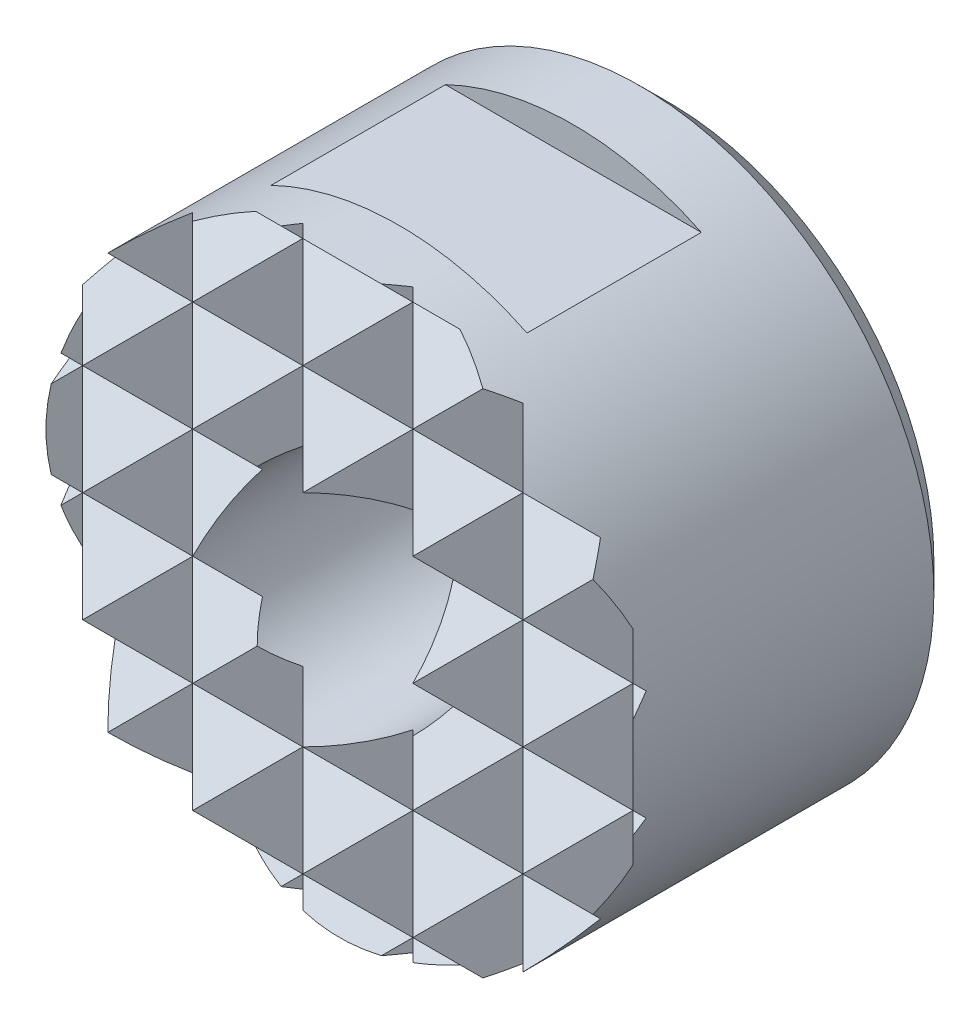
ISO-10303-21;
HEADER;
FILE_DESCRIPTION(('STEP AP214'),'2;1');
FILE_NAME('part.step','',(''),(''),'','','');
FILE_SCHEMA(('AUTOMOTIVE_DESIGN { 1 0 10303 214 1 1 1 1 }'));
ENDSEC;
DATA;
#1=APPLICATION_CONTEXT('core data for automotive mechanical design processes');
#2=APPLICATION_PROTOCOL_DEFINITION('international standard','automotive_design',2000,#1);
#3=PRODUCT_CONTEXT('',#1,'mechanical');
#4=PRODUCT('Part','Part','',(#3));
#5=PRODUCT_RELATED_PRODUCT_CATEGORY('part','',(#4));
#6=PRODUCT_DEFINITION_FORMATION('','',#4);
#7=PRODUCT_DEFINITION_CONTEXT('part definition',#1,'design');
#8=PRODUCT_DEFINITION('design','',#6,#7);
#9=PRODUCT_DEFINITION_SHAPE('','',#8);
#10=(LENGTH_UNIT() NAMED_UNIT(*) SI_UNIT(.MILLI.,.METRE.));
#11=(NAMED_UNIT(*) PLANE_ANGLE_UNIT() SI_UNIT($,.RADIAN.));
#12=(NAMED_UNIT(*) SI_UNIT($,.STERADIAN.) SOLID_ANGLE_UNIT());
#13=UNCERTAINTY_MEASURE_WITH_UNIT(LENGTH_MEASURE(1.E-05),#10,'distance_accuracy_value','');
#14=(GEOMETRIC_REPRESENTATION_CONTEXT(3) GLOBAL_UNCERTAINTY_ASSIGNED_CONTEXT((#13)) GLOBAL_UNIT_ASSIGNED_CONTEXT((#10,
#11,#12)) REPRESENTATION_CONTEXT('',''));
#15=CARTESIAN_POINT('',(0.,0.,0.));
#16=DIRECTION('',(0.,0.,1.));
#17=DIRECTION('',(1.,0.,0.));
#18=AXIS2_PLACEMENT_3D('',#15,#16,#17);
#19=CARTESIAN_POINT('',(4.5,-10.,8.5));
#20=DIRECTION('',(0.707106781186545,0.,-0.70710678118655));
#21=DIRECTION('',(-0.70710678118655,0.,-0.707106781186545));
#22=AXIS2_PLACEMENT_3D('',#19,#20,#21);
#23=PLANE('',#22);
#24=CARTESIAN_POINT('',(0.,0.,4.));
#25=DIRECTION('',(0.707106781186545,0.,-0.70710678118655));
#26=DIRECTION('',(-0.70710678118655,0.,-0.707106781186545));
#27=AXIS2_PLACEMENT_3D('',#24,#25,#26);
#28=ELLIPSE('',#27,11.3137084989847,8.);
#29=CARTESIAN_POINT('',(5.65685424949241,-5.65685424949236,9.65685424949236));
#30=VERTEX_POINT('',#29);
#31=CARTESIAN_POINT('',(4.5,-6.61437827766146,8.5));
#32=VERTEX_POINT('',#31);
#33=EDGE_CURVE('E798',#30,#32,#28,.T.);
#34=ORIENTED_EDGE('',*,*,#33,.F.);
#35=DIRECTION('',(-0.577350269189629,0.577350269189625,-0.577350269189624));
#36=VECTOR('',#35,1.);
#37=CARTESIAN_POINT('',(6.33333333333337,-6.33333333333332,10.3333333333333));
#38=LINE('',#37,#36);
#39=CARTESIAN_POINT('',(4.5,-4.5,8.5));
#40=VERTEX_POINT('',#39);
#41=EDGE_CURVE('E437',#30,#40,#38,.T.);
#42=ORIENTED_EDGE('',*,*,#41,.T.);
#43=DIRECTION('',(0.,1.,0.));
#44=VECTOR('',#43,1.);
#45=CARTESIAN_POINT('',(4.5,-10.,8.5));
#46=LINE('',#45,#44);
#47=EDGE_CURVE('E699',#32,#40,#46,.T.);
#48=ORIENTED_EDGE('',*,*,#47,.F.);
#49=EDGE_LOOP('',(#34,#42,#48));
#50=FACE_BOUND('',#49,.T.);
#51=ADVANCED_FACE('F15',(#50),#23,.F.);
#52=CARTESIAN_POINT('',(4.5,4.5,8.5));
#53=VERTEX_POINT('',#52);
#54=CARTESIAN_POINT('',(4.5,6.61437827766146,8.5));
#55=VERTEX_POINT('',#54);
#56=EDGE_CURVE('E702',#53,#55,#46,.T.);
#57=ORIENTED_EDGE('',*,*,#56,.F.);
#58=DIRECTION('',(0.577350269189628,0.577350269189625,0.577350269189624));
#59=VECTOR('',#58,1.);
#60=CARTESIAN_POINT('',(-0.333333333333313,-0.333333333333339,3.66666666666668));
#61=LINE('',#60,#59);
#62=CARTESIAN_POINT('',(5.65685424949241,5.65685424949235,9.65685424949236));
#63=VERTEX_POINT('',#62);
#64=EDGE_CURVE('E596',#53,#63,#61,.T.);
#65=ORIENTED_EDGE('',*,*,#64,.T.);
#66=EDGE_CURVE('E801',#55,#63,#28,.T.);
#67=ORIENTED_EDGE('',*,*,#66,.F.);
#68=EDGE_LOOP('',(#57,#65,#67));
#69=FACE_BOUND('',#68,.T.);
#70=ADVANCED_FACE('F1142',(#69),#23,.F.);
#71=CARTESIAN_POINT('',(6.,-10.,10.));
#72=DIRECTION('',(-0.70710678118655,0.,-0.707106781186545));
#73=DIRECTION('',(-0.707106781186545,0.,0.70710678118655));
#74=AXIS2_PLACEMENT_3D('',#71,#72,#73);
#75=PLANE('',#74);
#76=DIRECTION('',(-0.577350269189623,-0.577350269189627,0.577350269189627));
#77=VECTOR('',#76,1.);
#78=CARTESIAN_POINT('',(3.6666666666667,-5.33333333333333,12.3333333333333));
#79=LINE('',#78,#77);
#80=CARTESIAN_POINT('',(7.5,-1.5,8.5));
#81=VERTEX_POINT('',#80);
#82=CARTESIAN_POINT('',(6.,-3.,10.));
#83=VERTEX_POINT('',#82);
#84=EDGE_CURVE('E501',#81,#83,#79,.T.);
#85=ORIENTED_EDGE('',*,*,#84,.T.);
#86=DIRECTION('',(0.577350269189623,-0.577350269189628,-0.577350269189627));
#87=VECTOR('',#86,1.);
#88=CARTESIAN_POINT('',(8.33333333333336,-5.33333333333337,7.66666666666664));
#89=LINE('',#88,#87);
#90=CARTESIAN_POINT('',(6.95435605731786,-3.95435605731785,9.04564394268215));
#91=VERTEX_POINT('',#90);
#92=EDGE_CURVE('E468',#83,#91,#89,.T.);
#93=ORIENTED_EDGE('',*,*,#92,.T.);
#94=CARTESIAN_POINT('',(0.,0.,16.));
#95=DIRECTION('',(-0.70710678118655,0.,-0.707106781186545));
#96=DIRECTION('',(0.707106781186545,0.,-0.70710678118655));
#97=AXIS2_PLACEMENT_3D('',#94,#95,#96);
#98=ELLIPSE('',#97,11.3137084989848,8.);
#99=CARTESIAN_POINT('',(7.5,-2.78388218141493,8.5));
#100=VERTEX_POINT('',#99);
#101=EDGE_CURVE('E800',#100,#91,#98,.T.);
#102=ORIENTED_EDGE('',*,*,#101,.F.);
#103=DIRECTION('',(0.,1.,0.));
#104=VECTOR('',#103,1.);
#105=CARTESIAN_POINT('',(7.5,-10.,8.5));
#106=LINE('',#105,#104);
#107=EDGE_CURVE('E703',#100,#81,#106,.T.);
#108=ORIENTED_EDGE('',*,*,#107,.T.);
#109=EDGE_LOOP('',(#85,#93,#102,#108));
#110=FACE_BOUND('',#109,.T.);
#111=ADVANCED_FACE('F1089',(#110),#75,.F.);
#112=CARTESIAN_POINT('',(6.95435605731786,3.95435605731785,9.04564394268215));
#113=VERTEX_POINT('',#112);
#114=CARTESIAN_POINT('',(7.5,2.78388218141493,8.5));
#115=VERTEX_POINT('',#114);
#116=EDGE_CURVE('E805',#113,#115,#98,.T.);
#117=ORIENTED_EDGE('',*,*,#116,.F.);
#118=DIRECTION('',(-0.577350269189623,-0.577350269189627,0.577350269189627));
#119=VECTOR('',#118,1.);
#120=CARTESIAN_POINT('',(1.6666666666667,-1.33333333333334,14.3333333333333));
#121=LINE('',#120,#119);
#122=CARTESIAN_POINT('',(6.,3.,10.));
#123=VERTEX_POINT('',#122);
#124=EDGE_CURVE('E571',#113,#123,#121,.T.);
#125=ORIENTED_EDGE('',*,*,#124,.T.);
#126=DIRECTION('',(0.577350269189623,-0.577350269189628,-0.577350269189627));
#127=VECTOR('',#126,1.);
#128=CARTESIAN_POINT('',(10.3333333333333,-1.33333333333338,5.66666666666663));
#129=LINE('',#128,#127);
#130=CARTESIAN_POINT('',(7.5,1.5,8.5));
#131=VERTEX_POINT('',#130);
#132=EDGE_CURVE('E538',#123,#131,#129,.T.);
#133=ORIENTED_EDGE('',*,*,#132,.T.);
#134=EDGE_CURVE('E707',#131,#115,#106,.T.);
#135=ORIENTED_EDGE('',*,*,#134,.T.);
#136=EDGE_LOOP('',(#117,#125,#133,#135));
#137=FACE_BOUND('',#136,.T.);
#138=ADVANCED_FACE('F1191',(#137),#75,.F.);
#139=CARTESIAN_POINT('',(7.5,-10.,8.5));
#140=DIRECTION('',(0.707106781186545,0.,-0.70710678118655));
#141=DIRECTION('',(-0.70710678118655,0.,-0.707106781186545));
#142=AXIS2_PLACEMENT_3D('',#139,#140,#141);
#143=PLANE('',#142);
#144=EDGE_CURVE('E706',#81,#131,#106,.T.);
#145=ORIENTED_EDGE('',*,*,#144,.F.);
#146=DIRECTION('',(0.577350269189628,0.577350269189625,0.577350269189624));
#147=VECTOR('',#146,1.);
#148=CARTESIAN_POINT('',(4.6666666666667,-4.33333333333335,5.66666666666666));
#149=LINE('',#148,#147);
#150=CARTESIAN_POINT('',(7.92782730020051,-1.07217269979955,8.92782730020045));
#151=VERTEX_POINT('',#150);
#152=EDGE_CURVE('E689',#81,#151,#149,.T.);
#153=ORIENTED_EDGE('',*,*,#152,.T.);
#154=CARTESIAN_POINT('',(0.,0.,1.));
#155=DIRECTION('',(0.707106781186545,0.,-0.70710678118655));
#156=DIRECTION('',(-0.70710678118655,0.,-0.707106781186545));
#157=AXIS2_PLACEMENT_3D('',#154,#155,#156);
#158=ELLIPSE('',#157,11.3137084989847,8.);
#159=CARTESIAN_POINT('',(7.92782730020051,1.07217269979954,8.92782730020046));
#160=VERTEX_POINT('',#159);
#161=EDGE_CURVE('E809',#160,#151,#158,.T.);
#162=ORIENTED_EDGE('',*,*,#161,.F.);
#163=DIRECTION('',(-0.577350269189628,0.577350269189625,-0.577350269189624));
#164=VECTOR('',#163,1.);
#165=CARTESIAN_POINT('',(11.3333333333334,-2.3333333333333,12.3333333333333));
#166=LINE('',#165,#164);
#167=EDGE_CURVE('E657',#160,#131,#166,.T.);
#168=ORIENTED_EDGE('',*,*,#167,.T.);
#169=EDGE_LOOP('',(#145,#153,#162,#168));
#170=FACE_BOUND('',#169,.T.);
#171=ADVANCED_FACE('F1184',(#170),#143,.F.);
#172=ORIENTED_EDGE('',*,*,#134,.F.);
#173=DIRECTION('',(0.577350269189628,0.577350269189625,0.577350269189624));
#174=VECTOR('',#173,1.);
#175=CARTESIAN_POINT('',(3.66666666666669,-2.33333333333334,4.66666666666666));
#176=LINE('',#175,#174);
#177=CARTESIAN_POINT('',(7.79583152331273,1.79583152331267,8.79583152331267));
#178=VERTEX_POINT('',#177);
#179=EDGE_CURVE('E541',#131,#178,#176,.T.);
#180=ORIENTED_EDGE('',*,*,#179,.T.);
#181=EDGE_CURVE('E806',#115,#178,#158,.T.);
#182=ORIENTED_EDGE('',*,*,#181,.F.);
#183=EDGE_LOOP('',(#172,#180,#182));
#184=FACE_BOUND('',#183,.T.);
#185=ADVANCED_FACE('F1194',(#184),#143,.F.);
#186=CARTESIAN_POINT('',(-9.,-10.,10.));
#187=DIRECTION('',(-0.70710678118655,0.,-0.707106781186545));
#188=DIRECTION('',(-0.707106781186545,0.,0.70710678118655));
#189=AXIS2_PLACEMENT_3D('',#186,#187,#188);
#190=PLANE('',#189);
#191=CARTESIAN_POINT('',(0.,0.,1.));
#192=DIRECTION('',(-0.70710678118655,0.,-0.707106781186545));
#193=DIRECTION('',(0.707106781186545,0.,-0.70710678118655));
#194=AXIS2_PLACEMENT_3D('',#191,#192,#193);
#195=ELLIPSE('',#194,11.3137084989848,8.);
#196=CARTESIAN_POINT('',(-7.92782730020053,-1.07217269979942,8.92782730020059));
#197=VERTEX_POINT('',#196);
#198=CARTESIAN_POINT('',(-7.92782730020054,1.07217269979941,8.92782730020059));
#199=VERTEX_POINT('',#198);
#200=EDGE_CURVE('E797',#197,#199,#195,.T.);
#201=ORIENTED_EDGE('',*,*,#200,.F.);
#202=DIRECTION('',(0.577350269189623,-0.577350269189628,-0.577350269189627));
#203=VECTOR('',#202,1.);
#204=CARTESIAN_POINT('',(-5.66666666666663,-3.33333333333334,6.66666666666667));
#205=LINE('',#204,#203);
#206=CARTESIAN_POINT('',(-7.5,-1.5,8.5));
#207=VERTEX_POINT('',#206);
#208=EDGE_CURVE('E669',#197,#207,#205,.T.);
#209=ORIENTED_EDGE('',*,*,#208,.T.);
#210=DIRECTION('',(0.,1.,0.));
#211=VECTOR('',#210,1.);
#212=CARTESIAN_POINT('',(-7.5,-10.,8.5));
#213=LINE('',#212,#211);
#214=CARTESIAN_POINT('',(-7.5,1.5,8.5));
#215=VERTEX_POINT('',#214);
#216=EDGE_CURVE('E711',#207,#215,#213,.T.);
#217=ORIENTED_EDGE('',*,*,#216,.T.);
#218=DIRECTION('',(-0.577350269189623,-0.577350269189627,0.577350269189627));
#219=VECTOR('',#218,1.);
#220=CARTESIAN_POINT('',(-12.3333333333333,-3.33333333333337,13.3333333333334));
#221=LINE('',#220,#219);
#222=EDGE_CURVE('E640',#215,#199,#221,.T.);
#223=ORIENTED_EDGE('',*,*,#222,.T.);
#224=EDGE_LOOP('',(#201,#209,#217,#223));
#225=FACE_BOUND('',#224,.T.);
#226=ADVANCED_FACE('F1281',(#225),#190,.F.);
#227=CARTESIAN_POINT('',(-7.79583152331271,1.79583152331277,8.79583152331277));
#228=VERTEX_POINT('',#227);
#229=CARTESIAN_POINT('',(-7.5,2.78388218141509,8.5));
#230=VERTEX_POINT('',#229);
#231=EDGE_CURVE('E792',#228,#230,#195,.T.);
#232=ORIENTED_EDGE('',*,*,#231,.F.);
#233=DIRECTION('',(0.577350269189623,-0.577350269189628,-0.577350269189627));
#234=VECTOR('',#233,1.);
#235=CARTESIAN_POINT('',(-4.66666666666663,-1.33333333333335,5.66666666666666));
#236=LINE('',#235,#234);
#237=EDGE_CURVE('E519',#228,#215,#236,.T.);
#238=ORIENTED_EDGE('',*,*,#237,.T.);
#239=EDGE_CURVE('E712',#215,#230,#213,.T.);
#240=ORIENTED_EDGE('',*,*,#239,.T.);
#241=EDGE_LOOP('',(#232,#238,#240));
#242=FACE_BOUND('',#241,.T.);
#243=ADVANCED_FACE('F1284',(#242),#190,.F.);
#244=CARTESIAN_POINT('',(-7.5,-10.,8.5));
#245=DIRECTION('',(0.707106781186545,0.,-0.70710678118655));
#246=DIRECTION('',(-0.70710678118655,0.,-0.707106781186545));
#247=AXIS2_PLACEMENT_3D('',#244,#245,#246);
#248=PLANE('',#247);
#249=CARTESIAN_POINT('',(0.,0.,16.));
#250=DIRECTION('',(0.707106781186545,0.,-0.70710678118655));
#251=DIRECTION('',(-0.70710678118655,0.,-0.707106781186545));
#252=AXIS2_PLACEMENT_3D('',#249,#250,#251);
#253=ELLIPSE('',#252,11.3137084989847,8.);
#254=CARTESIAN_POINT('',(-6.95435605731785,-3.95435605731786,9.04564394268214));
#255=VERTEX_POINT('',#254);
#256=CARTESIAN_POINT('',(-7.5,-2.78388218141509,8.5));
#257=VERTEX_POINT('',#256);
#258=EDGE_CURVE('E789',#255,#257,#253,.T.);
#259=ORIENTED_EDGE('',*,*,#258,.F.);
#260=DIRECTION('',(0.577350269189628,0.577350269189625,0.577350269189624));
#261=VECTOR('',#260,1.);
#262=CARTESIAN_POINT('',(-9.33333333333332,-6.33333333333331,6.66666666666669));
#263=LINE('',#262,#261);
#264=CARTESIAN_POINT('',(-6.,-3.,10.));
#265=VERTEX_POINT('',#264);
#266=EDGE_CURVE('E452',#255,#265,#263,.T.);
#267=ORIENTED_EDGE('',*,*,#266,.T.);
#268=DIRECTION('',(-0.577350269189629,0.577350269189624,-0.577350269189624));
#269=VECTOR('',#268,1.);
#270=CARTESIAN_POINT('',(-4.66666666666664,-4.33333333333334,11.3333333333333));
#271=LINE('',#270,#269);
#272=EDGE_CURVE('E479',#265,#207,#271,.T.);
#273=ORIENTED_EDGE('',*,*,#272,.T.);
#274=EDGE_CURVE('E708',#257,#207,#213,.T.);
#275=ORIENTED_EDGE('',*,*,#274,.F.);
#276=EDGE_LOOP('',(#259,#267,#273,#275));
#277=FACE_BOUND('',#276,.T.);
#278=ADVANCED_FACE('F1028',(#277),#248,.F.);
#279=DIRECTION('',(0.577350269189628,0.577350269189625,0.577350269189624));
#280=VECTOR('',#279,1.);
#281=CARTESIAN_POINT('',(-11.3333333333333,-2.33333333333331,4.6666666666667));
#282=LINE('',#281,#280);
#283=CARTESIAN_POINT('',(-6.,3.,10.));
#284=VERTEX_POINT('',#283);
#285=EDGE_CURVE('E516',#215,#284,#282,.T.);
#286=ORIENTED_EDGE('',*,*,#285,.T.);
#287=DIRECTION('',(-0.577350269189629,0.577350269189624,-0.577350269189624));
#288=VECTOR('',#287,1.);
#289=CARTESIAN_POINT('',(-2.66666666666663,-0.333333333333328,13.3333333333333));
#290=LINE('',#289,#288);
#291=CARTESIAN_POINT('',(-6.95435605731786,3.95435605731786,9.04564394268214));
#292=VERTEX_POINT('',#291);
#293=EDGE_CURVE('E555',#284,#292,#290,.T.);
#294=ORIENTED_EDGE('',*,*,#293,.T.);
#295=EDGE_CURVE('E793',#230,#292,#253,.T.);
#296=ORIENTED_EDGE('',*,*,#295,.F.);
#297=ORIENTED_EDGE('',*,*,#239,.F.);
#298=EDGE_LOOP('',(#286,#294,#296,#297));
#299=FACE_BOUND('',#298,.T.);
#300=ADVANCED_FACE('F1266',(#299),#248,.F.);
#301=CARTESIAN_POINT('',(-6.,-10.,10.));
#302=DIRECTION('',(-0.70710678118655,0.,-0.707106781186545));
#303=DIRECTION('',(-0.707106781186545,0.,0.70710678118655));
#304=AXIS2_PLACEMENT_3D('',#301,#302,#303);
#305=PLANE('',#304);
#306=DIRECTION('',(0.,1.,0.));
#307=VECTOR('',#306,1.);
#308=CARTESIAN_POINT('',(-4.5,-10.,8.5));
#309=LINE('',#308,#307);
#310=CARTESIAN_POINT('',(-4.5,-6.6143782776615,8.5));
#311=VERTEX_POINT('',#310);
#312=CARTESIAN_POINT('',(-4.5,-4.5,8.5));
#313=VERTEX_POINT('',#312);
#314=EDGE_CURVE('E713',#311,#313,#309,.T.);
#315=ORIENTED_EDGE('',*,*,#314,.T.);
#316=DIRECTION('',(-0.577350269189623,-0.577350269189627,0.577350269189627));
#317=VECTOR('',#316,1.);
#318=CARTESIAN_POINT('',(-7.33333333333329,-7.33333333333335,11.3333333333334));
#319=LINE('',#318,#317);
#320=CARTESIAN_POINT('',(-5.65685424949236,-5.65685424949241,9.65685424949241));
#321=VERTEX_POINT('',#320);
#322=EDGE_CURVE('E425',#313,#321,#319,.T.);
#323=ORIENTED_EDGE('',*,*,#322,.T.);
#324=CARTESIAN_POINT('',(0.,0.,4.));
#325=DIRECTION('',(-0.70710678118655,0.,-0.707106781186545));
#326=DIRECTION('',(0.707106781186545,0.,-0.70710678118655));
#327=AXIS2_PLACEMENT_3D('',#324,#325,#326);
#328=ELLIPSE('',#327,11.3137084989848,8.);
#329=EDGE_CURVE('E786',#311,#321,#328,.T.);
#330=ORIENTED_EDGE('',*,*,#329,.F.);
#331=EDGE_LOOP('',(#315,#323,#330));
#332=FACE_BOUND('',#331,.T.);
#333=ADVANCED_FACE('F1038',(#332),#305,.F.);
#334=CARTESIAN_POINT('',(-5.65685424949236,5.6568542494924,9.65685424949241));
#335=VERTEX_POINT('',#334);
#336=CARTESIAN_POINT('',(-4.5,6.6143782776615,8.5));
#337=VERTEX_POINT('',#336);
#338=EDGE_CURVE('E790',#335,#337,#328,.T.);
#339=ORIENTED_EDGE('',*,*,#338,.F.);
#340=DIRECTION('',(0.577350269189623,-0.577350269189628,-0.577350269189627));
#341=VECTOR('',#340,1.);
#342=CARTESIAN_POINT('',(-0.666666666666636,0.666666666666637,4.66666666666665));
#343=LINE('',#342,#341);
#344=CARTESIAN_POINT('',(-4.5,4.5,8.5));
#345=VERTEX_POINT('',#344);
#346=EDGE_CURVE('E583',#335,#345,#343,.T.);
#347=ORIENTED_EDGE('',*,*,#346,.T.);
#348=EDGE_CURVE('E717',#345,#337,#309,.T.);
#349=ORIENTED_EDGE('',*,*,#348,.T.);
#350=EDGE_LOOP('',(#339,#347,#349));
#351=FACE_BOUND('',#350,.T.);
#352=ADVANCED_FACE('F1286',(#351),#305,.F.);
#353=CARTESIAN_POINT('',(0.,-10.,10.));
#354=DIRECTION('',(-0.70710678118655,0.,-0.707106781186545));
#355=DIRECTION('',(-0.707106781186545,0.,0.70710678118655));
#356=AXIS2_PLACEMENT_3D('',#353,#354,#355);
#357=PLANE('',#356);
#358=CARTESIAN_POINT('',(0.,0.,10.));
#359=DIRECTION('',(-0.70710678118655,0.,-0.707106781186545));
#360=DIRECTION('',(0.707106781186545,0.,-0.70710678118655));
#361=AXIS2_PLACEMENT_3D('',#358,#359,#360);
#362=ELLIPSE('',#361,11.3137084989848,8.);
#363=CARTESIAN_POINT('',(1.0721726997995,7.92782730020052,8.92782730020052));
#364=VERTEX_POINT('',#363);
#365=CARTESIAN_POINT('',(1.50000000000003,7.85811682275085,8.5));
#366=VERTEX_POINT('',#365);
#367=EDGE_CURVE('E742',#364,#366,#362,.T.);
#368=ORIENTED_EDGE('',*,*,#367,.F.);
#369=DIRECTION('',(0.577350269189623,-0.577350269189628,-0.577350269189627));
#370=VECTOR('',#369,1.);
#371=CARTESIAN_POINT('',(6.33333333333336,2.66666666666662,3.66666666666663));
#372=LINE('',#371,#370);
#373=CARTESIAN_POINT('',(1.50000000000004,7.5,8.5));
#374=VERTEX_POINT('',#373);
#375=EDGE_CURVE('E625',#364,#374,#372,.T.);
#376=ORIENTED_EDGE('',*,*,#375,.T.);
#377=DIRECTION('',(0.,1.,0.));
#378=VECTOR('',#377,1.);
#379=CARTESIAN_POINT('',(1.50000000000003,-10.,8.5));
#380=LINE('',#379,#378);
#381=EDGE_CURVE('E697',#374,#366,#380,.T.);
#382=ORIENTED_EDGE('',*,*,#381,.T.);
#383=EDGE_LOOP('',(#368,#376,#382));
#384=FACE_BOUND('',#383,.T.);
#385=ADVANCED_FACE('F868',(#384),#357,.F.);
#386=CARTESIAN_POINT('',(0.,0.,10.));
#387=DIRECTION('',(-0.70710678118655,0.,-0.707106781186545));
#388=DIRECTION('',(-0.707106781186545,0.,0.70710678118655));
#389=AXIS2_PLACEMENT_3D('',#386,#387,#388);
#390=ELLIPSE('',#389,4.2426406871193,3.);
#391=CARTESIAN_POINT('',(1.50000000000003,-2.5980762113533,8.5));
#392=VERTEX_POINT('',#391);
#393=CARTESIAN_POINT('',(0.,-3.,10.));
#394=VERTEX_POINT('',#393);
#395=EDGE_CURVE('E781',#392,#394,#390,.T.);
#396=ORIENTED_EDGE('',*,*,#395,.T.);
#397=DIRECTION('',(0.577350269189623,-0.577350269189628,-0.577350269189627));
#398=VECTOR('',#397,1.);
#399=CARTESIAN_POINT('',(2.33333333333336,-5.33333333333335,7.66666666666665));
#400=LINE('',#399,#398);
#401=CARTESIAN_POINT('',(1.50000000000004,-4.5,8.5));
#402=VERTEX_POINT('',#401);
#403=EDGE_CURVE('E446',#394,#402,#400,.T.);
#404=ORIENTED_EDGE('',*,*,#403,.T.);
#405=EDGE_CURVE('E695',#402,#392,#380,.T.);
#406=ORIENTED_EDGE('',*,*,#405,.T.);
#407=EDGE_LOOP('',(#396,#404,#406));
#408=FACE_BOUND('',#407,.T.);
#409=ADVANCED_FACE('F1342',(#408),#357,.F.);
#410=CARTESIAN_POINT('',(1.50000000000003,-10.,8.5));
#411=DIRECTION('',(0.707106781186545,0.,-0.70710678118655));
#412=DIRECTION('',(-0.70710678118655,0.,-0.707106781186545));
#413=AXIS2_PLACEMENT_3D('',#410,#411,#412);
#414=PLANE('',#413);
#415=ORIENTED_EDGE('',*,*,#381,.F.);
#416=DIRECTION('',(0.577350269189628,0.577350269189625,0.577350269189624));
#417=VECTOR('',#416,1.);
#418=CARTESIAN_POINT('',(-4.33333333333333,1.66666666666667,2.66666666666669));
#419=LINE('',#418,#417);
#420=CARTESIAN_POINT('',(1.79583152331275,7.79583152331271,8.79583152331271));
#421=VERTEX_POINT('',#420);
#422=EDGE_CURVE('E628',#374,#421,#419,.T.);
#423=ORIENTED_EDGE('',*,*,#422,.T.);
#424=CARTESIAN_POINT('',(0.,0.,7.));
#425=DIRECTION('',(0.707106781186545,0.,-0.70710678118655));
#426=DIRECTION('',(-0.70710678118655,0.,-0.707106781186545));
#427=AXIS2_PLACEMENT_3D('',#424,#425,#426);
#428=ELLIPSE('',#427,11.3137084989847,8.);
#429=EDGE_CURVE('E738',#366,#421,#428,.T.);
#430=ORIENTED_EDGE('',*,*,#429,.F.);
#431=EDGE_LOOP('',(#415,#423,#430));
#432=FACE_BOUND('',#431,.T.);
#433=ADVANCED_FACE('F872',(#432),#414,.F.);
#434=DIRECTION('',(0.577350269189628,0.577350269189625,0.577350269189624));
#435=VECTOR('',#434,1.);
#436=CARTESIAN_POINT('',(-0.333333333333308,-6.33333333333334,6.66666666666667));
#437=LINE('',#436,#435);
#438=CARTESIAN_POINT('',(3.,-3.,10.));
#439=VERTEX_POINT('',#438);
#440=EDGE_CURVE('E458',#402,#439,#437,.T.);
#441=ORIENTED_EDGE('',*,*,#440,.T.);
#442=DIRECTION('',(-0.577350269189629,0.577350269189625,-0.577350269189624));
#443=VECTOR('',#442,1.);
#444=CARTESIAN_POINT('',(4.33333333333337,-4.33333333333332,11.3333333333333));
#445=LINE('',#444,#443);
#446=CARTESIAN_POINT('',(2.12132034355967,-2.12132034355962,9.12132034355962));
#447=VERTEX_POINT('',#446);
#448=EDGE_CURVE('E495',#439,#447,#445,.T.);
#449=ORIENTED_EDGE('',*,*,#448,.T.);
#450=CARTESIAN_POINT('',(0.,0.,7.));
#451=DIRECTION('',(0.707106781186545,0.,-0.70710678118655));
#452=DIRECTION('',(0.70710678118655,0.,0.707106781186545));
#453=AXIS2_PLACEMENT_3D('',#450,#451,#452);
#454=ELLIPSE('',#453,4.24264068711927,3.);
#455=EDGE_CURVE('E785',#447,#392,#454,.T.);
#456=ORIENTED_EDGE('',*,*,#455,.T.);
#457=ORIENTED_EDGE('',*,*,#405,.F.);
#458=EDGE_LOOP('',(#441,#449,#456,#457));
#459=FACE_BOUND('',#458,.T.);
#460=ADVANCED_FACE('F1062',(#459),#414,.F.);
#461=CARTESIAN_POINT('',(3.00000000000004,-10.,10.));
#462=DIRECTION('',(-0.707106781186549,0.,-0.707106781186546));
#463=DIRECTION('',(-0.707106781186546,0.,0.707106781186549));
#464=AXIS2_PLACEMENT_3D('',#461,#462,#463);
#465=PLANE('',#464);
#466=DIRECTION('',(-0.577350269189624,-0.577350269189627,0.577350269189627));
#467=VECTOR('',#466,1.);
#468=CARTESIAN_POINT('',(1.6666666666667,-7.33333333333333,11.3333333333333));
#469=LINE('',#468,#467);
#470=CARTESIAN_POINT('',(3.00000000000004,-6.,10.));
#471=VERTEX_POINT('',#470);
#472=EDGE_CURVE('E435',#40,#471,#469,.T.);
#473=ORIENTED_EDGE('',*,*,#472,.T.);
#474=DIRECTION('',(0.577350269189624,-0.577350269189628,-0.577350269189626));
#475=VECTOR('',#474,1.);
#476=CARTESIAN_POINT('',(4.33333333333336,-7.33333333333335,8.66666666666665));
#477=LINE('',#476,#475);
#478=CARTESIAN_POINT('',(3.95435605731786,-6.95435605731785,9.04564394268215));
#479=VERTEX_POINT('',#478);
#480=EDGE_CURVE('E413',#471,#479,#477,.T.);
#481=ORIENTED_EDGE('',*,*,#480,.T.);
#482=CARTESIAN_POINT('',(0.,0.,13.));
#483=DIRECTION('',(-0.707106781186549,0.,-0.707106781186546));
#484=DIRECTION('',(0.707106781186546,0.,-0.707106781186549));
#485=AXIS2_PLACEMENT_3D('',#482,#483,#484);
#486=ELLIPSE('',#485,11.3137084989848,8.);
#487=EDGE_CURVE('E735',#32,#479,#486,.T.);
#488=ORIENTED_EDGE('',*,*,#487,.F.);
#489=ORIENTED_EDGE('',*,*,#47,.T.);
#490=EDGE_LOOP('',(#473,#481,#488,#489));
#491=FACE_BOUND('',#490,.T.);
#492=ADVANCED_FACE('F1110',(#491),#465,.F.);
#493=CARTESIAN_POINT('',(3.95435605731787,6.95435605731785,9.04564394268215));
#494=VERTEX_POINT('',#493);
#495=EDGE_CURVE('E733',#494,#55,#486,.T.);
#496=ORIENTED_EDGE('',*,*,#495,.F.);
#497=DIRECTION('',(-0.577350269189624,-0.577350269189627,0.577350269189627));
#498=VECTOR('',#497,1.);
#499=CARTESIAN_POINT('',(-2.33333333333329,0.666666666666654,15.3333333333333));
#500=LINE('',#499,#498);
#501=CARTESIAN_POINT('',(3.00000000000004,6.,10.));
#502=VERTEX_POINT('',#501);
#503=EDGE_CURVE('E615',#494,#502,#500,.T.);
#504=ORIENTED_EDGE('',*,*,#503,.T.);
#505=DIRECTION('',(0.577350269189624,-0.577350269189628,-0.577350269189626));
#506=VECTOR('',#505,1.);
#507=CARTESIAN_POINT('',(8.33333333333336,0.666666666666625,4.66666666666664));
#508=LINE('',#507,#506);
#509=EDGE_CURVE('E593',#502,#53,#508,.T.);
#510=ORIENTED_EDGE('',*,*,#509,.T.);
#511=ORIENTED_EDGE('',*,*,#56,.T.);
#512=EDGE_LOOP('',(#496,#504,#510,#511));
#513=FACE_BOUND('',#512,.T.);
#514=ADVANCED_FACE('F1171',(#513),#465,.F.);
#515=CARTESIAN_POINT('',(-4.5,-10.,8.5));
#516=DIRECTION('',(0.707106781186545,0.,-0.707106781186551));
#517=DIRECTION('',(-0.707106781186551,0.,-0.707106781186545));
#518=AXIS2_PLACEMENT_3D('',#515,#516,#517);
#519=PLANE('',#518);
#520=CARTESIAN_POINT('',(0.,0.,13.));
#521=DIRECTION('',(0.707106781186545,0.,-0.707106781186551));
#522=DIRECTION('',(-0.707106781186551,0.,-0.707106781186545));
#523=AXIS2_PLACEMENT_3D('',#520,#521,#522);
#524=ELLIPSE('',#523,11.3137084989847,8.);
#525=CARTESIAN_POINT('',(-3.95435605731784,-6.95435605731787,9.04564394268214));
#526=VERTEX_POINT('',#525);
#527=EDGE_CURVE('E730',#526,#311,#524,.T.);
#528=ORIENTED_EDGE('',*,*,#527,.F.);
#529=DIRECTION('',(0.577350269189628,0.577350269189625,0.577350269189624));
#530=VECTOR('',#529,1.);
#531=CARTESIAN_POINT('',(-5.33333333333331,-8.33333333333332,7.66666666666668));
#532=LINE('',#531,#530);
#533=CARTESIAN_POINT('',(-2.99999999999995,-6.,10.));
#534=VERTEX_POINT('',#533);
#535=EDGE_CURVE('E364',#526,#534,#532,.T.);
#536=ORIENTED_EDGE('',*,*,#535,.T.);
#537=DIRECTION('',(-0.577350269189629,0.577350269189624,-0.577350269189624));
#538=VECTOR('',#537,1.);
#539=CARTESIAN_POINT('',(-2.66666666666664,-6.33333333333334,10.3333333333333));
#540=LINE('',#539,#538);
#541=EDGE_CURVE('E419',#534,#313,#540,.T.);
#542=ORIENTED_EDGE('',*,*,#541,.T.);
#543=ORIENTED_EDGE('',*,*,#314,.F.);
#544=EDGE_LOOP('',(#528,#536,#542,#543));
#545=FACE_BOUND('',#544,.T.);
#546=ADVANCED_FACE('F1041',(#545),#519,.F.);
#547=DIRECTION('',(0.577350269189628,0.577350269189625,0.577350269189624));
#548=VECTOR('',#547,1.);
#549=CARTESIAN_POINT('',(-9.33333333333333,-0.333333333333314,3.6666666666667));
#550=LINE('',#549,#548);
#551=CARTESIAN_POINT('',(-2.99999999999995,6.,10.));
#552=VERTEX_POINT('',#551);
#553=EDGE_CURVE('E577',#345,#552,#550,.T.);
#554=ORIENTED_EDGE('',*,*,#553,.T.);
#555=DIRECTION('',(-0.577350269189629,0.577350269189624,-0.577350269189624));
#556=VECTOR('',#555,1.);
#557=CARTESIAN_POINT('',(1.33333333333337,1.66666666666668,14.3333333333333));
#558=LINE('',#557,#556);
#559=CARTESIAN_POINT('',(-3.95435605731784,6.95435605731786,9.04564394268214));
#560=VERTEX_POINT('',#559);
#561=EDGE_CURVE('E602',#552,#560,#558,.T.);
#562=ORIENTED_EDGE('',*,*,#561,.T.);
#563=EDGE_CURVE('E732',#337,#560,#524,.T.);
#564=ORIENTED_EDGE('',*,*,#563,.F.);
#565=ORIENTED_EDGE('',*,*,#348,.F.);
#566=EDGE_LOOP('',(#554,#562,#564,#565));
#567=FACE_BOUND('',#566,.T.);
#568=ADVANCED_FACE('F1288',(#567),#519,.F.);
#569=CARTESIAN_POINT('',(-2.99999999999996,-10.,10.));
#570=DIRECTION('',(-0.70710678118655,0.,-0.707106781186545));
#571=DIRECTION('',(-0.707106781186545,0.,0.70710678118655));
#572=AXIS2_PLACEMENT_3D('',#569,#570,#571);
#573=PLANE('',#572);
#574=CARTESIAN_POINT('',(0.,0.,7.));
#575=DIRECTION('',(-0.70710678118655,0.,-0.707106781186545));
#576=DIRECTION('',(-0.707106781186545,0.,0.70710678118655));
#577=AXIS2_PLACEMENT_3D('',#574,#575,#576);
#578=ELLIPSE('',#577,4.2426406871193,3.);
#579=CARTESIAN_POINT('',(-1.49999999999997,-2.59807621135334,8.5));
#580=VERTEX_POINT('',#579);
#581=CARTESIAN_POINT('',(-2.12132034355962,-2.12132034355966,9.12132034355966));
#582=VERTEX_POINT('',#581);
#583=EDGE_CURVE('E779',#580,#582,#578,.T.);
#584=ORIENTED_EDGE('',*,*,#583,.T.);
#585=DIRECTION('',(-0.577350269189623,-0.577350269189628,0.577350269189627));
#586=VECTOR('',#585,1.);
#587=CARTESIAN_POINT('',(-5.33333333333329,-5.33333333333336,12.3333333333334));
#588=LINE('',#587,#586);
#589=CARTESIAN_POINT('',(-2.99999999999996,-3.,10.));
#590=VERTEX_POINT('',#589);
#591=EDGE_CURVE('E471',#582,#590,#588,.T.);
#592=ORIENTED_EDGE('',*,*,#591,.T.);
#593=DIRECTION('',(0.577350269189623,-0.577350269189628,-0.577350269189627));
#594=VECTOR('',#593,1.);
#595=CARTESIAN_POINT('',(-0.666666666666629,-5.33333333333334,7.66666666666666));
#596=LINE('',#595,#594);
#597=CARTESIAN_POINT('',(-1.49999999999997,-4.5,8.5));
#598=VERTEX_POINT('',#597);
#599=EDGE_CURVE('E440',#590,#598,#596,.T.);
#600=ORIENTED_EDGE('',*,*,#599,.T.);
#601=DIRECTION('',(0.,1.,0.));
#602=VECTOR('',#601,1.);
#603=CARTESIAN_POINT('',(-1.49999999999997,-10.,8.5));
#604=LINE('',#603,#602);
#605=EDGE_CURVE('E721',#598,#580,#604,.T.);
#606=ORIENTED_EDGE('',*,*,#605,.T.);
#607=EDGE_LOOP('',(#584,#592,#600,#606));
#608=FACE_BOUND('',#607,.T.);
#609=ADVANCED_FACE('F1051',(#608),#573,.F.);
#610=CARTESIAN_POINT('',(0.,0.,7.));
#611=DIRECTION('',(-0.70710678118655,0.,-0.707106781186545));
#612=DIRECTION('',(0.707106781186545,0.,-0.70710678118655));
#613=AXIS2_PLACEMENT_3D('',#610,#611,#612);
#614=ELLIPSE('',#613,11.3137084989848,8.);
#615=CARTESIAN_POINT('',(-1.79583152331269,7.79583152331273,8.79583152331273));
#616=VERTEX_POINT('',#615);
#617=CARTESIAN_POINT('',(-1.49999999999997,7.85811682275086,8.5));
#618=VERTEX_POINT('',#617);
#619=EDGE_CURVE('E728',#616,#618,#614,.T.);
#620=ORIENTED_EDGE('',*,*,#619,.F.);
#621=DIRECTION('',(0.577350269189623,-0.577350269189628,-0.577350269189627));
#622=VECTOR('',#621,1.);
#623=CARTESIAN_POINT('',(3.33333333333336,2.66666666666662,3.66666666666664));
#624=LINE('',#623,#622);
#625=CARTESIAN_POINT('',(-1.49999999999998,7.5,8.5));
#626=VERTEX_POINT('',#625);
#627=EDGE_CURVE('E617',#616,#626,#624,.T.);
#628=ORIENTED_EDGE('',*,*,#627,.T.);
#629=EDGE_CURVE('E723',#626,#618,#604,.T.);
#630=ORIENTED_EDGE('',*,*,#629,.T.);
#631=EDGE_LOOP('',(#620,#628,#630));
#632=FACE_BOUND('',#631,.T.);
#633=ADVANCED_FACE('F1292',(#632),#573,.F.);
#634=CARTESIAN_POINT('',(-1.49999999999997,-10.,8.5));
#635=DIRECTION('',(0.707106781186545,0.,-0.70710678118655));
#636=DIRECTION('',(-0.70710678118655,0.,-0.707106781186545));
#637=AXIS2_PLACEMENT_3D('',#634,#635,#636);
#638=PLANE('',#637);
#639=ORIENTED_EDGE('',*,*,#629,.F.);
#640=DIRECTION('',(0.577350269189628,0.577350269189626,0.577350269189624));
#641=VECTOR('',#640,1.);
#642=CARTESIAN_POINT('',(-7.33333333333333,1.66666666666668,2.66666666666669));
#643=LINE('',#642,#641);
#644=CARTESIAN_POINT('',(-1.07217269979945,7.92782730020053,8.92782730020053));
#645=VERTEX_POINT('',#644);
#646=EDGE_CURVE('E9',#626,#645,#643,.T.);
#647=ORIENTED_EDGE('',*,*,#646,.T.);
#648=CARTESIAN_POINT('',(0.,0.,10.));
#649=DIRECTION('',(0.707106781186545,0.,-0.70710678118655));
#650=DIRECTION('',(-0.70710678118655,0.,-0.707106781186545));
#651=AXIS2_PLACEMENT_3D('',#648,#649,#650);
#652=ELLIPSE('',#651,11.3137084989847,8.);
#653=EDGE_CURVE('E727',#618,#645,#652,.T.);
#654=ORIENTED_EDGE('',*,*,#653,.F.);
#655=EDGE_LOOP('',(#639,#647,#654));
#656=FACE_BOUND('',#655,.T.);
#657=ADVANCED_FACE('F880',(#656),#638,.F.);
#658=ORIENTED_EDGE('',*,*,#605,.F.);
#659=DIRECTION('',(0.577350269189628,0.577350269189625,0.577350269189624));
#660=VECTOR('',#659,1.);
#661=CARTESIAN_POINT('',(-3.33333333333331,-6.33333333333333,6.66666666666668));
#662=LINE('',#661,#660);
#663=EDGE_CURVE('E819',#598,#394,#662,.T.);
#664=ORIENTED_EDGE('',*,*,#663,.T.);
#665=CARTESIAN_POINT('',(0.,0.,10.));
#666=DIRECTION('',(0.707106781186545,0.,-0.70710678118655));
#667=DIRECTION('',(0.70710678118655,0.,0.707106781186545));
#668=AXIS2_PLACEMENT_3D('',#665,#666,#667);
#669=ELLIPSE('',#668,4.24264068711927,3.);
#670=EDGE_CURVE('E776',#394,#580,#669,.T.);
#671=ORIENTED_EDGE('',*,*,#670,.T.);
#672=EDGE_LOOP('',(#658,#664,#671));
#673=FACE_BOUND('',#672,.T.);
#674=ADVANCED_FACE('F1241',(#673),#638,.F.);
#675=CARTESIAN_POINT('',(0.,0.,0.));
#676=DIRECTION('',(0.,0.,1.));
#677=DIRECTION('',(1.,0.,0.));
#678=AXIS2_PLACEMENT_3D('',#675,#676,#677);
#679=PLANE('',#678);
#680=CARTESIAN_POINT('',(0.,0.,0.));
#681=DIRECTION('',(0.,0.,1.));
#682=DIRECTION('',(1.,0.,0.));
#683=AXIS2_PLACEMENT_3D('',#680,#681,#682);
#684=CIRCLE('',#683,7.2);
#685=CARTESIAN_POINT('',(7.2,0.,0.));
#686=VERTEX_POINT('',#685);
#687=EDGE_CURVE('E757',#686,#686,#684,.F.);
#688=ORIENTED_EDGE('',*,*,#687,.T.);
#689=EDGE_LOOP('',(#688));
#690=FACE_BOUND('',#689,.T.);
#691=CARTESIAN_POINT('',(0.,0.,0.));
#692=DIRECTION('',(0.,0.,1.));
#693=DIRECTION('',(1.,0.,0.));
#694=AXIS2_PLACEMENT_3D('',#691,#692,#693);
#695=CIRCLE('',#694,3.45);
#696=CARTESIAN_POINT('',(3.45,0.,0.));
#697=VERTEX_POINT('',#696);
#698=EDGE_CURVE('E751',#697,#697,#695,.T.);
#699=ORIENTED_EDGE('',*,*,#698,.T.);
#700=EDGE_LOOP('',(#699));
#701=FACE_BOUND('',#700,.T.);
#702=ADVANCED_FACE('F1334',(#690,#701),#679,.F.);
#703=CARTESIAN_POINT('',(0.,0.,10.));
#704=DIRECTION('',(0.,0.,-1.));
#705=DIRECTION('',(-1.,0.,0.));
#706=AXIS2_PLACEMENT_3D('',#703,#704,#705);
#707=CYLINDRICAL_SURFACE('',#706,8.);
#708=CARTESIAN_POINT('',(0.,0.,7.375));
#709=DIRECTION('',(0.,0.,1.));
#710=DIRECTION('',(0.,-1.,0.));
#711=AXIS2_PLACEMENT_3D('',#708,#709,#710);
#712=CIRCLE('',#711,8.);
#713=CARTESIAN_POINT('',(3.48711915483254,7.2,7.375));
#714=VERTEX_POINT('',#713);
#715=CARTESIAN_POINT('',(-3.48711915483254,7.2,7.375));
#716=VERTEX_POINT('',#715);
#717=EDGE_CURVE('E766',#714,#716,#712,.T.);
#718=ORIENTED_EDGE('',*,*,#717,.T.);
#719=DIRECTION('',(0.,0.,-1.));
#720=VECTOR('',#719,1.);
#721=CARTESIAN_POINT('',(-3.48711915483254,7.2,10.));
#722=LINE('',#721,#720);
#723=CARTESIAN_POINT('',(-3.48711915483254,7.2,2.625));
#724=VERTEX_POINT('',#723);
#725=EDGE_CURVE('E769',#716,#724,#722,.T.);
#726=ORIENTED_EDGE('',*,*,#725,.T.);
#727=CARTESIAN_POINT('',(0.,0.,2.625));
#728=DIRECTION('',(0.,0.,-1.));
#729=DIRECTION('',(-1.,0.,0.));
#730=AXIS2_PLACEMENT_3D('',#727,#728,#729);
#731=CIRCLE('',#730,8.);
#732=CARTESIAN_POINT('',(3.48711915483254,7.2,2.625));
#733=VERTEX_POINT('',#732);
#734=EDGE_CURVE('E763',#724,#733,#731,.T.);
#735=ORIENTED_EDGE('',*,*,#734,.T.);
#736=DIRECTION('',(0.,0.,-1.));
#737=VECTOR('',#736,1.);
#738=CARTESIAN_POINT('',(3.48711915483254,7.2,10.));
#739=LINE('',#738,#737);
#740=EDGE_CURVE('E760',#733,#714,#739,.F.);
#741=ORIENTED_EDGE('',*,*,#740,.T.);
#742=EDGE_LOOP('',(#718,#726,#735,#741));
#743=FACE_BOUND('',#742,.T.);
#744=CARTESIAN_POINT('',(0.,0.,0.8));
#745=DIRECTION('',(0.,0.,1.));
#746=DIRECTION('',(1.,0.,0.));
#747=AXIS2_PLACEMENT_3D('',#744,#745,#746);
#748=CIRCLE('',#747,8.);
#749=CARTESIAN_POINT('',(8.,0.,0.8));
#750=VERTEX_POINT('',#749);
#751=EDGE_CURVE('E754',#750,#750,#748,.T.);
#752=ORIENTED_EDGE('',*,*,#751,.T.);
#753=EDGE_LOOP('',(#752));
#754=FACE_BOUND('',#753,.T.);
#755=ORIENTED_EDGE('',*,*,#161,.T.);
#756=CARTESIAN_POINT('',(0.,0.,10.));
#757=DIRECTION('',(0.,0.707106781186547,-0.707106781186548));
#758=DIRECTION('',(0.,-0.707106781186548,-0.707106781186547));
#759=AXIS2_PLACEMENT_3D('',#756,#757,#758);
#760=ELLIPSE('',#759,11.3137084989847,8.);
#761=CARTESIAN_POINT('',(7.85811682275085,-1.5,8.5));
#762=VERTEX_POINT('',#761);
#763=EDGE_CURVE('E680',#151,#762,#760,.T.);
#764=ORIENTED_EDGE('',*,*,#763,.T.);
#765=CARTESIAN_POINT('',(0.,0.,7.));
#766=DIRECTION('',(0.,-0.707106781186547,-0.707106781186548));
#767=DIRECTION('',(0.,0.707106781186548,-0.707106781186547));
#768=AXIS2_PLACEMENT_3D('',#765,#766,#767);
#769=ELLIPSE('',#768,11.3137084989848,8.);
#770=CARTESIAN_POINT('',(7.79583152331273,-1.79583152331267,8.79583152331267));
#771=VERTEX_POINT('',#770);
#772=EDGE_CURVE('E492',#762,#771,#769,.T.);
#773=ORIENTED_EDGE('',*,*,#772,.T.);
#774=EDGE_CURVE('E804',#771,#100,#158,.T.);
#775=ORIENTED_EDGE('',*,*,#774,.T.);
#776=ORIENTED_EDGE('',*,*,#101,.T.);
#777=CARTESIAN_POINT('',(0.,0.,13.));
#778=DIRECTION('',(0.,0.707106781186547,-0.707106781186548));
#779=DIRECTION('',(0.,-0.707106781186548,-0.707106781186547));
#780=AXIS2_PLACEMENT_3D('',#777,#778,#779);
#781=ELLIPSE('',#780,11.3137084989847,8.);
#782=CARTESIAN_POINT('',(6.61437827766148,-4.5,8.5));
#783=VERTEX_POINT('',#782);
#784=EDGE_CURVE('E459',#91,#783,#781,.T.);
#785=ORIENTED_EDGE('',*,*,#784,.T.);
#786=CARTESIAN_POINT('',(0.,0.,4.));
#787=DIRECTION('',(0.,-0.707106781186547,-0.707106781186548));
#788=DIRECTION('',(0.,0.707106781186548,-0.707106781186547));
#789=AXIS2_PLACEMENT_3D('',#786,#787,#788);
#790=ELLIPSE('',#789,11.3137084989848,8.);
#791=EDGE_CURVE('E432',#783,#30,#790,.T.);
#792=ORIENTED_EDGE('',*,*,#791,.T.);
#793=ORIENTED_EDGE('',*,*,#33,.T.);
#794=ORIENTED_EDGE('',*,*,#487,.T.);
#795=CARTESIAN_POINT('',(0.,0.,16.));
#796=DIRECTION('',(0.,0.707106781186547,-0.707106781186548));
#797=DIRECTION('',(0.,-0.707106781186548,-0.707106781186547));
#798=AXIS2_PLACEMENT_3D('',#795,#796,#797);
#799=ELLIPSE('',#798,11.3137084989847,8.);
#800=CARTESIAN_POINT('',(2.78388218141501,-7.5,8.5));
#801=VERTEX_POINT('',#800);
#802=EDGE_CURVE('E371',#479,#801,#799,.T.);
#803=ORIENTED_EDGE('',*,*,#802,.T.);
#804=CARTESIAN_POINT('',(0.,0.,1.));
#805=DIRECTION('',(0.,-0.707106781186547,-0.707106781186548));
#806=DIRECTION('',(0.,0.707106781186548,-0.707106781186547));
#807=AXIS2_PLACEMENT_3D('',#804,#805,#806);
#808=ELLIPSE('',#807,11.3137084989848,8.);
#809=CARTESIAN_POINT('',(1.79583152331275,-7.79583152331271,8.79583152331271));
#810=VERTEX_POINT('',#809);
#811=EDGE_CURVE('E388',#801,#810,#808,.T.);
#812=ORIENTED_EDGE('',*,*,#811,.T.);
#813=CARTESIAN_POINT('',(1.50000000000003,-7.85811682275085,8.5));
#814=VERTEX_POINT('',#813);
#815=EDGE_CURVE('E736',#810,#814,#428,.T.);
#816=ORIENTED_EDGE('',*,*,#815,.T.);
#817=CARTESIAN_POINT('',(1.07217269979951,-7.92782730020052,8.92782730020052));
#818=VERTEX_POINT('',#817);
#819=EDGE_CURVE('E739',#814,#818,#362,.T.);
#820=ORIENTED_EDGE('',*,*,#819,.T.);
#821=CARTESIAN_POINT('',(-1.07217269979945,-7.92782730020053,8.92782730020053));
#822=VERTEX_POINT('',#821);
#823=EDGE_CURVE('E386',#818,#822,#808,.T.);
#824=ORIENTED_EDGE('',*,*,#823,.T.);
#825=CARTESIAN_POINT('',(-1.49999999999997,-7.85811682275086,8.5));
#826=VERTEX_POINT('',#825);
#827=EDGE_CURVE('E725',#822,#826,#652,.T.);
#828=ORIENTED_EDGE('',*,*,#827,.T.);
#829=CARTESIAN_POINT('',(-1.79583152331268,-7.79583152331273,8.79583152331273));
#830=VERTEX_POINT('',#829);
#831=EDGE_CURVE('E385',#826,#830,#614,.T.);
#832=ORIENTED_EDGE('',*,*,#831,.T.);
#833=CARTESIAN_POINT('',(-2.78388218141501,-7.5,8.5));
#834=VERTEX_POINT('',#833);
#835=EDGE_CURVE('E374',#830,#834,#808,.T.);
#836=ORIENTED_EDGE('',*,*,#835,.T.);
#837=EDGE_CURVE('E358',#834,#526,#799,.T.);
#838=ORIENTED_EDGE('',*,*,#837,.T.);
#839=ORIENTED_EDGE('',*,*,#527,.T.);
#840=ORIENTED_EDGE('',*,*,#329,.T.);
#841=CARTESIAN_POINT('',(-6.61437827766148,-4.5,8.5));
#842=VERTEX_POINT('',#841);
#843=EDGE_CURVE('E428',#321,#842,#790,.T.);
#844=ORIENTED_EDGE('',*,*,#843,.T.);
#845=EDGE_CURVE('E455',#842,#255,#781,.T.);
#846=ORIENTED_EDGE('',*,*,#845,.T.);
#847=ORIENTED_EDGE('',*,*,#258,.T.);
#848=CARTESIAN_POINT('',(-7.79583152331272,-1.79583152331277,8.79583152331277));
#849=VERTEX_POINT('',#848);
#850=EDGE_CURVE('E794',#257,#849,#195,.T.);
#851=ORIENTED_EDGE('',*,*,#850,.T.);
#852=CARTESIAN_POINT('',(-7.85811682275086,-1.5,8.5));
#853=VERTEX_POINT('',#852);
#854=EDGE_CURVE('E487',#849,#853,#769,.T.);
#855=ORIENTED_EDGE('',*,*,#854,.T.);
#856=EDGE_CURVE('E675',#853,#197,#760,.T.);
#857=ORIENTED_EDGE('',*,*,#856,.T.);
#858=ORIENTED_EDGE('',*,*,#200,.T.);
#859=CARTESIAN_POINT('',(0.,0.,10.));
#860=DIRECTION('',(0.,-0.707106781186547,-0.707106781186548));
#861=DIRECTION('',(0.,0.707106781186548,-0.707106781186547));
#862=AXIS2_PLACEMENT_3D('',#859,#860,#861);
#863=ELLIPSE('',#862,11.3137084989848,8.);
#864=CARTESIAN_POINT('',(-7.85811682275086,1.5,8.5));
#865=VERTEX_POINT('',#864);
#866=EDGE_CURVE('E645',#199,#865,#863,.T.);
#867=ORIENTED_EDGE('',*,*,#866,.T.);
#868=CARTESIAN_POINT('',(0.,0.,7.));
#869=DIRECTION('',(0.,0.707106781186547,-0.707106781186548));
#870=DIRECTION('',(0.,-0.707106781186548,-0.707106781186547));
#871=AXIS2_PLACEMENT_3D('',#868,#869,#870);
#872=ELLIPSE('',#871,11.3137084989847,8.);
#873=EDGE_CURVE('E524',#865,#228,#872,.T.);
#874=ORIENTED_EDGE('',*,*,#873,.T.);
#875=ORIENTED_EDGE('',*,*,#231,.T.);
#876=ORIENTED_EDGE('',*,*,#295,.T.);
#877=CARTESIAN_POINT('',(0.,0.,13.));
#878=DIRECTION('',(0.,-0.707106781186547,-0.707106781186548));
#879=DIRECTION('',(0.,0.707106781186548,-0.707106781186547));
#880=AXIS2_PLACEMENT_3D('',#877,#878,#879);
#881=ELLIPSE('',#880,11.3137084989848,8.);
#882=CARTESIAN_POINT('',(-6.61437827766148,4.5,8.5));
#883=VERTEX_POINT('',#882);
#884=EDGE_CURVE('E558',#292,#883,#881,.T.);
#885=ORIENTED_EDGE('',*,*,#884,.T.);
#886=CARTESIAN_POINT('',(0.,0.,4.));
#887=DIRECTION('',(0.,0.707106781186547,-0.707106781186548));
#888=DIRECTION('',(0.,-0.707106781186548,-0.707106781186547));
#889=AXIS2_PLACEMENT_3D('',#886,#887,#888);
#890=ELLIPSE('',#889,11.3137084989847,8.);
#891=EDGE_CURVE('E586',#883,#335,#890,.T.);
#892=ORIENTED_EDGE('',*,*,#891,.T.);
#893=ORIENTED_EDGE('',*,*,#338,.T.);
#894=ORIENTED_EDGE('',*,*,#563,.T.);
#895=CARTESIAN_POINT('',(0.,0.,16.));
#896=DIRECTION('',(0.,-0.707106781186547,-0.707106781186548));
#897=DIRECTION('',(0.,0.707106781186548,-0.707106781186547));
#898=AXIS2_PLACEMENT_3D('',#895,#896,#897);
#899=ELLIPSE('',#898,11.3137084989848,8.);
#900=CARTESIAN_POINT('',(-2.78388218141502,7.5,8.5));
#901=VERTEX_POINT('',#900);
#902=EDGE_CURVE('E608',#560,#901,#899,.T.);
#903=ORIENTED_EDGE('',*,*,#902,.T.);
#904=CARTESIAN_POINT('',(0.,0.,1.00000000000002));
#905=DIRECTION('',(0.,0.707106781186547,-0.707106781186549));
#906=DIRECTION('',(0.,-0.707106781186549,-0.707106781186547));
#907=AXIS2_PLACEMENT_3D('',#904,#905,#906);
#908=ELLIPSE('',#907,11.3137084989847,8.);
#909=EDGE_CURVE('E623',#901,#616,#908,.T.);
#910=ORIENTED_EDGE('',*,*,#909,.T.);
#911=ORIENTED_EDGE('',*,*,#619,.T.);
#912=ORIENTED_EDGE('',*,*,#653,.T.);
#913=EDGE_CURVE('E620',#645,#364,#908,.T.);
#914=ORIENTED_EDGE('',*,*,#913,.T.);
#915=ORIENTED_EDGE('',*,*,#367,.T.);
#916=ORIENTED_EDGE('',*,*,#429,.T.);
#917=CARTESIAN_POINT('',(2.78388218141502,7.5,8.5));
#918=VERTEX_POINT('',#917);
#919=EDGE_CURVE('E624',#421,#918,#908,.T.);
#920=ORIENTED_EDGE('',*,*,#919,.T.);
#921=EDGE_CURVE('E612',#918,#494,#899,.T.);
#922=ORIENTED_EDGE('',*,*,#921,.T.);
#923=ORIENTED_EDGE('',*,*,#495,.T.);
#924=ORIENTED_EDGE('',*,*,#66,.T.);
#925=CARTESIAN_POINT('',(6.61437827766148,4.5,8.5));
#926=VERTEX_POINT('',#925);
#927=EDGE_CURVE('E590',#63,#926,#890,.T.);
#928=ORIENTED_EDGE('',*,*,#927,.T.);
#929=EDGE_CURVE('E562',#926,#113,#881,.T.);
#930=ORIENTED_EDGE('',*,*,#929,.T.);
#931=ORIENTED_EDGE('',*,*,#116,.T.);
#932=ORIENTED_EDGE('',*,*,#181,.T.);
#933=CARTESIAN_POINT('',(7.85811682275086,1.5,8.5));
#934=VERTEX_POINT('',#933);
#935=EDGE_CURVE('E529',#178,#934,#872,.T.);
#936=ORIENTED_EDGE('',*,*,#935,.T.);
#937=EDGE_CURVE('E650',#934,#160,#863,.T.);
#938=ORIENTED_EDGE('',*,*,#937,.T.);
#939=EDGE_LOOP('',(#755,#764,#773,#775,#776,#785,#792,#793,#794,#803,#812,#816,#820,#824,#828,
#832,#836,#838,#839,#840,#844,#846,#847,#851,#855,#857,#858,#867,#874,#875,#876,#885,#892,#893,
#894,#903,#910,#911,#912,#914,#915,#916,#920,#922,#923,#924,#928,#930,#931,#932,#936,#938));
#940=FACE_BOUND('',#939,.T.);
#941=ADVANCED_FACE('F383',(#743,#754,#940),#707,.T.);
#942=CARTESIAN_POINT('',(0.,0.,10.));
#943=DIRECTION('',(0.,0.,1.));
#944=DIRECTION('',(1.,0.,0.));
#945=AXIS2_PLACEMENT_3D('',#942,#943,#944);
#946=CYLINDRICAL_SURFACE('',#945,3.);
#947=CARTESIAN_POINT('',(0.,0.,7.));
#948=DIRECTION('',(0.,-0.707106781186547,-0.707106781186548));
#949=DIRECTION('',(0.,-0.707106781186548,0.707106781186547));
#950=AXIS2_PLACEMENT_3D('',#947,#948,#949);
#951=ELLIPSE('',#950,4.24264068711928,3.);
#952=CARTESIAN_POINT('',(-2.59807621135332,-1.5,8.5));
#953=VERTEX_POINT('',#952);
#954=EDGE_CURVE('E485',#582,#953,#951,.T.);
#955=ORIENTED_EDGE('',*,*,#954,.F.);
#956=ORIENTED_EDGE('',*,*,#583,.F.);
#957=ORIENTED_EDGE('',*,*,#670,.F.);
#958=ORIENTED_EDGE('',*,*,#395,.F.);
#959=ORIENTED_EDGE('',*,*,#455,.F.);
#960=CARTESIAN_POINT('',(2.59807621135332,-1.5,8.5));
#961=VERTEX_POINT('',#960);
#962=EDGE_CURVE('E488',#961,#447,#951,.T.);
#963=ORIENTED_EDGE('',*,*,#962,.F.);
#964=CARTESIAN_POINT('',(0.,0.,10.));
#965=DIRECTION('',(0.,0.707106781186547,-0.707106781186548));
#966=DIRECTION('',(0.,0.707106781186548,0.707106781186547));
#967=AXIS2_PLACEMENT_3D('',#964,#965,#966);
#968=ELLIPSE('',#967,4.24264068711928,3.);
#969=CARTESIAN_POINT('',(3.,0.,10.));
#970=VERTEX_POINT('',#969);
#971=EDGE_CURVE('E676',#970,#961,#968,.T.);
#972=ORIENTED_EDGE('',*,*,#971,.F.);
#973=CARTESIAN_POINT('',(0.,0.,10.));
#974=DIRECTION('',(0.,-0.707106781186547,-0.707106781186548));
#975=DIRECTION('',(0.,-0.707106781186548,0.707106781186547));
#976=AXIS2_PLACEMENT_3D('',#973,#974,#975);
#977=ELLIPSE('',#976,4.24264068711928,3.);
#978=CARTESIAN_POINT('',(2.59807621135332,1.5,8.5));
#979=VERTEX_POINT('',#978);
#980=EDGE_CURVE('E646',#979,#970,#977,.T.);
#981=ORIENTED_EDGE('',*,*,#980,.F.);
#982=CARTESIAN_POINT('',(0.,0.,7.));
#983=DIRECTION('',(0.,0.707106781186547,-0.707106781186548));
#984=DIRECTION('',(0.,0.707106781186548,0.707106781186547));
#985=AXIS2_PLACEMENT_3D('',#982,#983,#984);
#986=ELLIPSE('',#985,4.24264068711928,3.);
#987=CARTESIAN_POINT('',(2.12132034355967,2.12132034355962,9.12132034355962));
#988=VERTEX_POINT('',#987);
#989=EDGE_CURVE('E525',#988,#979,#986,.T.);
#990=ORIENTED_EDGE('',*,*,#989,.F.);
#991=CARTESIAN_POINT('',(1.50000000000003,2.5980762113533,8.5));
#992=VERTEX_POINT('',#991);
#993=EDGE_CURVE('E782',#992,#988,#454,.T.);
#994=ORIENTED_EDGE('',*,*,#993,.F.);
#995=CARTESIAN_POINT('',(0.,3.,10.));
#996=VERTEX_POINT('',#995);
#997=EDGE_CURVE('E778',#996,#992,#390,.T.);
#998=ORIENTED_EDGE('',*,*,#997,.F.);
#999=CARTESIAN_POINT('',(-1.49999999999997,2.59807621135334,8.5));
#1000=VERTEX_POINT('',#999);
#1001=EDGE_CURVE('E772',#1000,#996,#669,.T.);
#1002=ORIENTED_EDGE('',*,*,#1001,.F.);
#1003=CARTESIAN_POINT('',(-2.12132034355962,2.12132034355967,9.12132034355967));
#1004=VERTEX_POINT('',#1003);
#1005=EDGE_CURVE('E775',#1004,#1000,#578,.T.);
#1006=ORIENTED_EDGE('',*,*,#1005,.F.);
#1007=CARTESIAN_POINT('',(-2.59807621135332,1.5,8.5));
#1008=VERTEX_POINT('',#1007);
#1009=EDGE_CURVE('E522',#1008,#1004,#986,.T.);
#1010=ORIENTED_EDGE('',*,*,#1009,.F.);
#1011=CARTESIAN_POINT('',(-2.99999999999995,0.,10.));
#1012=VERTEX_POINT('',#1011);
#1013=EDGE_CURVE('E643',#1012,#1008,#977,.T.);
#1014=ORIENTED_EDGE('',*,*,#1013,.F.);
#1015=EDGE_CURVE('E672',#953,#1012,#968,.T.);
#1016=ORIENTED_EDGE('',*,*,#1015,.F.);
#1017=EDGE_LOOP('',(#955,#956,#957,#958,#959,#963,#972,#981,#990,#994,#998,#1002,#1006,#1010,
#1014,#1016));
#1018=FACE_BOUND('',#1017,.T.);
#1019=CARTESIAN_POINT('',(0.,0.,0.45));
#1020=DIRECTION('',(0.,0.,1.));
#1021=DIRECTION('',(1.,0.,0.));
#1022=AXIS2_PLACEMENT_3D('',#1019,#1020,#1021);
#1023=CIRCLE('',#1022,3.);
#1024=CARTESIAN_POINT('',(3.,0.,0.45));
#1025=VERTEX_POINT('',#1024);
#1026=EDGE_CURVE('E746',#1025,#1025,#1023,.F.);
#1027=ORIENTED_EDGE('',*,*,#1026,.T.);
#1028=EDGE_LOOP('',(#1027));
#1029=FACE_BOUND('',#1028,.T.);
#1030=ADVANCED_FACE('F948',(#1018,#1029),#946,.F.);
#1031=CARTESIAN_POINT('',(0.,0.,0.45));
#1032=DIRECTION('',(0.,0.,-1.));
#1033=DIRECTION('',(-1.,0.,0.));
#1034=AXIS2_PLACEMENT_3D('',#1031,#1032,#1033);
#1035=CONICAL_SURFACE('',#1034,3.,0.78539816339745);
#1036=ORIENTED_EDGE('',*,*,#698,.F.);
#1037=EDGE_LOOP('',(#1036));
#1038=FACE_BOUND('',#1037,.T.);
#1039=ORIENTED_EDGE('',*,*,#1026,.F.);
#1040=EDGE_LOOP('',(#1039));
#1041=FACE_BOUND('',#1040,.T.);
#1042=ADVANCED_FACE('F1491',(#1038,#1041),#1035,.F.);
#1043=CARTESIAN_POINT('',(0.,0.,0.8));
#1044=DIRECTION('',(0.,0.,1.));
#1045=DIRECTION('',(1.,0.,0.));
#1046=AXIS2_PLACEMENT_3D('',#1043,#1044,#1045);
#1047=CONICAL_SURFACE('',#1046,8.,0.785398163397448);
#1048=ORIENTED_EDGE('',*,*,#687,.F.);
#1049=EDGE_LOOP('',(#1048));
#1050=FACE_BOUND('',#1049,.T.);
#1051=ORIENTED_EDGE('',*,*,#751,.F.);
#1052=EDGE_LOOP('',(#1051));
#1053=FACE_BOUND('',#1052,.T.);
#1054=ADVANCED_FACE('F17',(#1050,#1053),#1047,.T.);
#1055=CARTESIAN_POINT('',(-5.,9.08443006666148,7.375));
#1056=DIRECTION('',(0.,0.,1.));
#1057=DIRECTION('',(0.,-1.,0.));
#1058=AXIS2_PLACEMENT_3D('',#1055,#1056,#1057);
#1059=PLANE('',#1058);
#1060=DIRECTION('',(1.,0.,0.));
#1061=VECTOR('',#1060,1.);
#1062=CARTESIAN_POINT('',(-5.,7.2,7.375));
#1063=LINE('',#1062,#1061);
#1064=EDGE_CURVE('E747',#716,#714,#1063,.T.);
#1065=ORIENTED_EDGE('',*,*,#1064,.F.);
#1066=ORIENTED_EDGE('',*,*,#717,.F.);
#1067=EDGE_LOOP('',(#1065,#1066));
#1068=FACE_BOUND('',#1067,.T.);
#1069=ADVANCED_FACE('F1508',(#1068),#1059,.F.);
#1070=CARTESIAN_POINT('',(-5.,9.08443006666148,2.625));
#1071=DIRECTION('',(0.,0.,-1.));
#1072=DIRECTION('',(-1.,0.,0.));
#1073=AXIS2_PLACEMENT_3D('',#1070,#1071,#1072);
#1074=PLANE('',#1073);
#1075=DIRECTION('',(1.,0.,0.));
#1076=VECTOR('',#1075,1.);
#1077=CARTESIAN_POINT('',(-5.,7.2,2.625));
#1078=LINE('',#1077,#1076);
#1079=EDGE_CURVE('E743',#724,#733,#1078,.T.);
#1080=ORIENTED_EDGE('',*,*,#1079,.T.);
#1081=ORIENTED_EDGE('',*,*,#734,.F.);
#1082=EDGE_LOOP('',(#1080,#1081));
#1083=FACE_BOUND('',#1082,.T.);
#1084=ADVANCED_FACE('F1517',(#1083),#1074,.F.);
#1085=CARTESIAN_POINT('',(-5.,7.2,7.375));
#1086=DIRECTION('',(0.,-1.,0.));
#1087=DIRECTION('',(0.,0.,-1.));
#1088=AXIS2_PLACEMENT_3D('',#1085,#1086,#1087);
#1089=PLANE('',#1088);
#1090=ORIENTED_EDGE('',*,*,#1064,.T.);
#1091=ORIENTED_EDGE('',*,*,#740,.F.);
#1092=ORIENTED_EDGE('',*,*,#1079,.F.);
#1093=ORIENTED_EDGE('',*,*,#725,.F.);
#1094=EDGE_LOOP('',(#1090,#1091,#1092,#1093));
#1095=FACE_BOUND('',#1094,.T.);
#1096=ADVANCED_FACE('F1527',(#1095),#1089,.F.);
#1097=DIRECTION('',(-0.577350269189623,-0.577350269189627,0.577350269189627));
#1098=VECTOR('',#1097,1.);
#1099=CARTESIAN_POINT('',(2.6666666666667,-3.33333333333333,13.3333333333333));
#1100=LINE('',#1099,#1098);
#1101=CARTESIAN_POINT('',(6.,0.,10.));
#1102=VERTEX_POINT('',#1101);
#1103=EDGE_CURVE('E654',#131,#1102,#1100,.T.);
#1104=ORIENTED_EDGE('',*,*,#1103,.T.);
#1105=DIRECTION('',(0.577350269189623,-0.577350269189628,-0.577350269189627));
#1106=VECTOR('',#1105,1.);
#1107=CARTESIAN_POINT('',(9.33333333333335,-3.33333333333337,6.66666666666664));
#1108=LINE('',#1107,#1106);
#1109=EDGE_CURVE('E686',#1102,#81,#1108,.T.);
#1110=ORIENTED_EDGE('',*,*,#1109,.T.);
#1111=ORIENTED_EDGE('',*,*,#144,.T.);
#1112=EDGE_LOOP('',(#1104,#1110,#1111));
#1113=FACE_BOUND('',#1112,.T.);
#1114=ADVANCED_FACE('F1180',(#1113),#75,.F.);
#1115=ORIENTED_EDGE('',*,*,#774,.F.);
#1116=DIRECTION('',(-0.577350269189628,0.577350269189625,-0.577350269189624));
#1117=VECTOR('',#1116,1.);
#1118=CARTESIAN_POINT('',(10.3333333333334,-4.33333333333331,11.3333333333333));
#1119=LINE('',#1118,#1117);
#1120=EDGE_CURVE('E504',#771,#81,#1119,.T.);
#1121=ORIENTED_EDGE('',*,*,#1120,.T.);
#1122=ORIENTED_EDGE('',*,*,#107,.F.);
#1123=EDGE_LOOP('',(#1115,#1121,#1122));
#1124=FACE_BOUND('',#1123,.T.);
#1125=ADVANCED_FACE('F1403',(#1124),#143,.F.);
#1126=ORIENTED_EDGE('',*,*,#274,.T.);
#1127=DIRECTION('',(-0.577350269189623,-0.577350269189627,0.577350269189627));
#1128=VECTOR('',#1127,1.);
#1129=CARTESIAN_POINT('',(-11.3333333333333,-5.33333333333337,12.3333333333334));
#1130=LINE('',#1129,#1128);
#1131=EDGE_CURVE('E482',#207,#849,#1130,.T.);
#1132=ORIENTED_EDGE('',*,*,#1131,.T.);
#1133=ORIENTED_EDGE('',*,*,#850,.F.);
#1134=EDGE_LOOP('',(#1126,#1132,#1133));
#1135=FACE_BOUND('',#1134,.T.);
#1136=ADVANCED_FACE('F1397',(#1135),#190,.F.);
#1137=ORIENTED_EDGE('',*,*,#216,.F.);
#1138=DIRECTION('',(0.577350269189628,0.577350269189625,0.577350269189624));
#1139=VECTOR('',#1138,1.);
#1140=CARTESIAN_POINT('',(-10.3333333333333,-4.33333333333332,5.6666666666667));
#1141=LINE('',#1140,#1139);
#1142=CARTESIAN_POINT('',(-6.,0.,10.));
#1143=VERTEX_POINT('',#1142);
#1144=EDGE_CURVE('E666',#207,#1143,#1141,.T.);
#1145=ORIENTED_EDGE('',*,*,#1144,.T.);
#1146=DIRECTION('',(-0.577350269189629,0.577350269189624,-0.577350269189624));
#1147=VECTOR('',#1146,1.);
#1148=CARTESIAN_POINT('',(-3.66666666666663,-2.33333333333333,12.3333333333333));
#1149=LINE('',#1148,#1147);
#1150=EDGE_CURVE('E637',#1143,#215,#1149,.T.);
#1151=ORIENTED_EDGE('',*,*,#1150,.T.);
#1152=EDGE_LOOP('',(#1137,#1145,#1151));
#1153=FACE_BOUND('',#1152,.T.);
#1154=ADVANCED_FACE('F1393',(#1153),#248,.F.);
#1155=CARTESIAN_POINT('',(1.50000000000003,4.5,8.5));
#1156=VERTEX_POINT('',#1155);
#1157=EDGE_CURVE('E692',#992,#1156,#380,.T.);
#1158=ORIENTED_EDGE('',*,*,#1157,.T.);
#1159=DIRECTION('',(-0.577350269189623,-0.577350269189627,0.577350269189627));
#1160=VECTOR('',#1159,1.);
#1161=CARTESIAN_POINT('',(-4.33333333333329,-1.33333333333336,14.3333333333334));
#1162=LINE('',#1161,#1160);
#1163=EDGE_CURVE('E549',#1156,#996,#1162,.T.);
#1164=ORIENTED_EDGE('',*,*,#1163,.T.);
#1165=ORIENTED_EDGE('',*,*,#997,.T.);
#1166=EDGE_LOOP('',(#1158,#1164,#1165));
#1167=FACE_BOUND('',#1166,.T.);
#1168=ADVANCED_FACE('F976',(#1167),#357,.F.);
#1169=CARTESIAN_POINT('',(1.50000000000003,-7.5,8.5));
#1170=VERTEX_POINT('',#1169);
#1171=EDGE_CURVE('E698',#814,#1170,#380,.T.);
#1172=ORIENTED_EDGE('',*,*,#1171,.T.);
#1173=DIRECTION('',(-0.577350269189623,-0.577350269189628,0.577350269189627));
#1174=VECTOR('',#1173,1.);
#1175=CARTESIAN_POINT('',(-0.333333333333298,-9.33333333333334,10.3333333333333));
#1176=LINE('',#1175,#1174);
#1177=EDGE_CURVE('E390',#1170,#818,#1176,.T.);
#1178=ORIENTED_EDGE('',*,*,#1177,.T.);
#1179=ORIENTED_EDGE('',*,*,#819,.F.);
#1180=EDGE_LOOP('',(#1172,#1178,#1179));
#1181=FACE_BOUND('',#1180,.T.);
#1182=ADVANCED_FACE('F1348',(#1181),#357,.F.);
#1183=DIRECTION('',(0.577350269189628,0.577350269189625,0.577350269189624));
#1184=VECTOR('',#1183,1.);
#1185=CARTESIAN_POINT('',(-2.33333333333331,-2.33333333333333,4.66666666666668));
#1186=LINE('',#1185,#1184);
#1187=CARTESIAN_POINT('',(3.,3.,10.));
#1188=VERTEX_POINT('',#1187);
#1189=EDGE_CURVE('E532',#988,#1188,#1186,.T.);
#1190=ORIENTED_EDGE('',*,*,#1189,.T.);
#1191=DIRECTION('',(-0.577350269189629,0.577350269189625,-0.577350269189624));
#1192=VECTOR('',#1191,1.);
#1193=CARTESIAN_POINT('',(6.33333333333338,-0.333333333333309,13.3333333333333));
#1194=LINE('',#1193,#1192);
#1195=EDGE_CURVE('E561',#1188,#1156,#1194,.T.);
#1196=ORIENTED_EDGE('',*,*,#1195,.T.);
#1197=ORIENTED_EDGE('',*,*,#1157,.F.);
#1198=ORIENTED_EDGE('',*,*,#993,.T.);
#1199=EDGE_LOOP('',(#1190,#1196,#1197,#1198));
#1200=FACE_BOUND('',#1199,.T.);
#1201=ADVANCED_FACE('F980',(#1200),#414,.F.);
#1202=ORIENTED_EDGE('',*,*,#815,.F.);
#1203=DIRECTION('',(-0.577350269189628,0.577350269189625,-0.577350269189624));
#1204=VECTOR('',#1203,1.);
#1205=CARTESIAN_POINT('',(2.33333333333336,-8.33333333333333,9.33333333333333));
#1206=LINE('',#1205,#1204);
#1207=EDGE_CURVE('E396',#810,#1170,#1206,.T.);
#1208=ORIENTED_EDGE('',*,*,#1207,.T.);
#1209=ORIENTED_EDGE('',*,*,#1171,.F.);
#1210=EDGE_LOOP('',(#1202,#1208,#1209));
#1211=FACE_BOUND('',#1210,.T.);
#1212=ADVANCED_FACE('F1374',(#1211),#414,.F.);
#1213=CARTESIAN_POINT('',(-1.49999999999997,-7.5,8.5));
#1214=VERTEX_POINT('',#1213);
#1215=EDGE_CURVE('E724',#826,#1214,#604,.T.);
#1216=ORIENTED_EDGE('',*,*,#1215,.T.);
#1217=DIRECTION('',(-0.577350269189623,-0.577350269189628,0.577350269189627));
#1218=VECTOR('',#1217,1.);
#1219=CARTESIAN_POINT('',(-3.33333333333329,-9.33333333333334,10.3333333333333));
#1220=LINE('',#1219,#1218);
#1221=EDGE_CURVE('E376',#1214,#830,#1220,.T.);
#1222=ORIENTED_EDGE('',*,*,#1221,.T.);
#1223=ORIENTED_EDGE('',*,*,#831,.F.);
#1224=EDGE_LOOP('',(#1216,#1222,#1223));
#1225=FACE_BOUND('',#1224,.T.);
#1226=ADVANCED_FACE('F1309',(#1225),#573,.F.);
#1227=CARTESIAN_POINT('',(-1.49999999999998,4.5,8.5));
#1228=VERTEX_POINT('',#1227);
#1229=EDGE_CURVE('E718',#1000,#1228,#604,.T.);
#1230=ORIENTED_EDGE('',*,*,#1229,.T.);
#1231=DIRECTION('',(-0.577350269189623,-0.577350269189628,0.577350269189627));
#1232=VECTOR('',#1231,1.);
#1233=CARTESIAN_POINT('',(-7.33333333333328,-1.33333333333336,14.3333333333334));
#1234=LINE('',#1233,#1232);
#1235=CARTESIAN_POINT('',(-2.99999999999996,3.,10.));
#1236=VERTEX_POINT('',#1235);
#1237=EDGE_CURVE('E544',#1228,#1236,#1234,.T.);
#1238=ORIENTED_EDGE('',*,*,#1237,.T.);
#1239=DIRECTION('',(0.577350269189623,-0.577350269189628,-0.577350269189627));
#1240=VECTOR('',#1239,1.);
#1241=CARTESIAN_POINT('',(1.33333333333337,-1.33333333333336,5.66666666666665));
#1242=LINE('',#1241,#1240);
#1243=EDGE_CURVE('E507',#1236,#1004,#1242,.T.);
#1244=ORIENTED_EDGE('',*,*,#1243,.T.);
#1245=ORIENTED_EDGE('',*,*,#1005,.T.);
#1246=EDGE_LOOP('',(#1230,#1238,#1244,#1245));
#1247=FACE_BOUND('',#1246,.T.);
#1248=ADVANCED_FACE('F957',(#1247),#573,.F.);
#1249=ORIENTED_EDGE('',*,*,#1001,.T.);
#1250=DIRECTION('',(-0.577350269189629,0.577350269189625,-0.577350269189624));
#1251=VECTOR('',#1250,1.);
#1252=CARTESIAN_POINT('',(3.33333333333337,-0.333333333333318,13.3333333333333));
#1253=LINE('',#1252,#1251);
#1254=EDGE_CURVE('E822',#996,#1228,#1253,.T.);
#1255=ORIENTED_EDGE('',*,*,#1254,.T.);
#1256=ORIENTED_EDGE('',*,*,#1229,.F.);
#1257=EDGE_LOOP('',(#1249,#1255,#1256));
#1258=FACE_BOUND('',#1257,.T.);
#1259=ADVANCED_FACE('F970',(#1258),#638,.F.);
#1260=ORIENTED_EDGE('',*,*,#827,.F.);
#1261=DIRECTION('',(-0.577350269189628,0.577350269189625,-0.577350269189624));
#1262=VECTOR('',#1261,1.);
#1263=CARTESIAN_POINT('',(-0.666666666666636,-8.33333333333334,9.33333333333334));
#1264=LINE('',#1263,#1262);
#1265=EDGE_CURVE('E810',#822,#1214,#1264,.T.);
#1266=ORIENTED_EDGE('',*,*,#1265,.T.);
#1267=ORIENTED_EDGE('',*,*,#1215,.F.);
#1268=EDGE_LOOP('',(#1260,#1266,#1267));
#1269=FACE_BOUND('',#1268,.T.);
#1270=ADVANCED_FACE('F1137',(#1269),#638,.F.);
#1271=CARTESIAN_POINT('',(-10.,-7.5,8.5));
#1272=DIRECTION('',(0.,-0.707106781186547,-0.707106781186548));
#1273=DIRECTION('',(0.,0.707106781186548,-0.707106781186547));
#1274=AXIS2_PLACEMENT_3D('',#1271,#1272,#1273);
#1275=PLANE('',#1274);
#1276=DIRECTION('',(1.,0.,0.));
#1277=VECTOR('',#1276,1.);
#1278=CARTESIAN_POINT('',(-10.,-7.5,8.5));
#1279=LINE('',#1278,#1277);
#1280=EDGE_CURVE('E378',#1214,#1170,#1279,.T.);
#1281=ORIENTED_EDGE('',*,*,#1280,.F.);
#1282=ORIENTED_EDGE('',*,*,#1265,.F.);
#1283=ORIENTED_EDGE('',*,*,#823,.F.);
#1284=ORIENTED_EDGE('',*,*,#1177,.F.);
#1285=EDGE_LOOP('',(#1281,#1282,#1283,#1284));
#1286=FACE_BOUND('',#1285,.T.);
#1287=ADVANCED_FACE('F1123',(#1286),#1275,.F.);
#1288=CARTESIAN_POINT('',(-10.,-6.,10.));
#1289=DIRECTION('',(0.,0.707106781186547,-0.707106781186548));
#1290=DIRECTION('',(0.,0.707106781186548,0.707106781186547));
#1291=AXIS2_PLACEMENT_3D('',#1288,#1289,#1290);
#1292=PLANE('',#1291);
#1293=DIRECTION('',(0.577350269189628,0.577350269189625,0.577350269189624));
#1294=VECTOR('',#1293,1.);
#1295=CARTESIAN_POINT('',(-2.33333333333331,-8.33333333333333,7.66666666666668));
#1296=LINE('',#1295,#1294);
#1297=CARTESIAN_POINT('',(0.,-6.,10.));
#1298=VERTEX_POINT('',#1297);
#1299=EDGE_CURVE('E813',#1214,#1298,#1296,.T.);
#1300=ORIENTED_EDGE('',*,*,#1299,.F.);
#1301=ORIENTED_EDGE('',*,*,#1280,.T.);
#1302=DIRECTION('',(0.577350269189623,-0.577350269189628,-0.577350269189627));
#1303=VECTOR('',#1302,1.);
#1304=CARTESIAN_POINT('',(1.33333333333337,-7.33333333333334,8.66666666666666));
#1305=LINE('',#1304,#1303);
#1306=EDGE_CURVE('E369',#1298,#1170,#1305,.T.);
#1307=ORIENTED_EDGE('',*,*,#1306,.F.);
#1308=EDGE_LOOP('',(#1300,#1301,#1307));
#1309=FACE_BOUND('',#1308,.T.);
#1310=ADVANCED_FACE('F1134',(#1309),#1292,.F.);
#1311=ORIENTED_EDGE('',*,*,#1299,.T.);
#1312=DIRECTION('',(-0.577350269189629,0.577350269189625,-0.577350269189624));
#1313=VECTOR('',#1312,1.);
#1314=CARTESIAN_POINT('',(0.333333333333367,-6.33333333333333,10.3333333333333));
#1315=LINE('',#1314,#1313);
#1316=EDGE_CURVE('E816',#1298,#598,#1315,.T.);
#1317=ORIENTED_EDGE('',*,*,#1316,.T.);
#1318=EDGE_CURVE('E887',#1214,#598,#604,.T.);
#1319=ORIENTED_EDGE('',*,*,#1318,.F.);
#1320=EDGE_LOOP('',(#1311,#1317,#1319));
#1321=FACE_BOUND('',#1320,.T.);
#1322=ADVANCED_FACE('F1319',(#1321),#638,.F.);
#1323=ORIENTED_EDGE('',*,*,#1318,.T.);
#1324=DIRECTION('',(-0.577350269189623,-0.577350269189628,0.577350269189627));
#1325=VECTOR('',#1324,1.);
#1326=CARTESIAN_POINT('',(-4.33333333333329,-7.33333333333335,11.3333333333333));
#1327=LINE('',#1326,#1325);
#1328=EDGE_CURVE('E416',#598,#534,#1327,.T.);
#1329=ORIENTED_EDGE('',*,*,#1328,.T.);
#1330=DIRECTION('',(0.577350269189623,-0.577350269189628,-0.577350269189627));
#1331=VECTOR('',#1330,1.);
#1332=CARTESIAN_POINT('',(-1.66666666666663,-7.33333333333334,8.66666666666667));
#1333=LINE('',#1332,#1331);
#1334=EDGE_CURVE('E395',#534,#1214,#1333,.T.);
#1335=ORIENTED_EDGE('',*,*,#1334,.T.);
#1336=EDGE_LOOP('',(#1323,#1329,#1335));
#1337=FACE_BOUND('',#1336,.T.);
#1338=ADVANCED_FACE('F1313',(#1337),#573,.F.);
#1339=CARTESIAN_POINT('',(-10.,-4.5,8.5));
#1340=DIRECTION('',(0.,-0.707106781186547,-0.707106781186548));
#1341=DIRECTION('',(0.,0.707106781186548,-0.707106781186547));
#1342=AXIS2_PLACEMENT_3D('',#1339,#1340,#1341);
#1343=PLANE('',#1342);
#1344=DIRECTION('',(1.,0.,0.));
#1345=VECTOR('',#1344,1.);
#1346=CARTESIAN_POINT('',(-10.,-4.5,8.5));
#1347=LINE('',#1346,#1345);
#1348=EDGE_CURVE('E1049',#598,#402,#1347,.T.);
#1349=ORIENTED_EDGE('',*,*,#1348,.F.);
#1350=ORIENTED_EDGE('',*,*,#1316,.F.);
#1351=DIRECTION('',(-0.577350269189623,-0.577350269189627,0.577350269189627));
#1352=VECTOR('',#1351,1.);
#1353=CARTESIAN_POINT('',(-1.3333333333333,-7.33333333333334,11.3333333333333));
#1354=LINE('',#1353,#1352);
#1355=EDGE_CURVE('E422',#402,#1298,#1354,.T.);
#1356=ORIENTED_EDGE('',*,*,#1355,.F.);
#1357=EDGE_LOOP('',(#1349,#1350,#1356));
#1358=FACE_BOUND('',#1357,.T.);
#1359=ADVANCED_FACE('F1246',(#1358),#1343,.F.);
#1360=CARTESIAN_POINT('',(-10.,-3.,10.));
#1361=DIRECTION('',(0.,0.707106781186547,-0.707106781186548));
#1362=DIRECTION('',(0.,0.707106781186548,0.707106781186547));
#1363=AXIS2_PLACEMENT_3D('',#1360,#1361,#1362);
#1364=PLANE('',#1363);
#1365=ORIENTED_EDGE('',*,*,#663,.F.);
#1366=ORIENTED_EDGE('',*,*,#1348,.T.);
#1367=ORIENTED_EDGE('',*,*,#403,.F.);
#1368=EDGE_LOOP('',(#1365,#1366,#1367));
#1369=FACE_BOUND('',#1368,.T.);
#1370=ADVANCED_FACE('F1242',(#1369),#1364,.F.);
#1371=CARTESIAN_POINT('',(-10.,4.5,8.5));
#1372=DIRECTION('',(0.,-0.707106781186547,-0.707106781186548));
#1373=DIRECTION('',(0.,0.707106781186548,-0.707106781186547));
#1374=AXIS2_PLACEMENT_3D('',#1371,#1372,#1373);
#1375=PLANE('',#1374);
#1376=DIRECTION('',(1.,0.,0.));
#1377=VECTOR('',#1376,1.);
#1378=CARTESIAN_POINT('',(-10.,4.5,8.5));
#1379=LINE('',#1378,#1377);
#1380=EDGE_CURVE('E844',#1228,#1156,#1379,.T.);
#1381=ORIENTED_EDGE('',*,*,#1380,.F.);
#1382=ORIENTED_EDGE('',*,*,#1254,.F.);
#1383=ORIENTED_EDGE('',*,*,#1163,.F.);
#1384=EDGE_LOOP('',(#1381,#1382,#1383));
#1385=FACE_BOUND('',#1384,.T.);
#1386=ADVANCED_FACE('F974',(#1385),#1375,.F.);
#1387=CARTESIAN_POINT('',(-10.,6.,10.));
#1388=DIRECTION('',(0.,0.707106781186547,-0.707106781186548));
#1389=DIRECTION('',(0.,0.707106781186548,0.707106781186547));
#1390=AXIS2_PLACEMENT_3D('',#1387,#1388,#1389);
#1391=PLANE('',#1390);
#1392=DIRECTION('',(0.577350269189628,0.577350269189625,0.577350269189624));
#1393=VECTOR('',#1392,1.);
#1394=CARTESIAN_POINT('',(-6.33333333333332,-0.333333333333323,3.66666666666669));
#1395=LINE('',#1394,#1393);
#1396=CARTESIAN_POINT('',(0.,6.,10.));
#1397=VERTEX_POINT('',#1396);
#1398=EDGE_CURVE('E825',#1228,#1397,#1395,.T.);
#1399=ORIENTED_EDGE('',*,*,#1398,.F.);
#1400=ORIENTED_EDGE('',*,*,#1380,.T.);
#1401=DIRECTION('',(0.577350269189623,-0.577350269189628,-0.577350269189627));
#1402=VECTOR('',#1401,1.);
#1403=CARTESIAN_POINT('',(5.33333333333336,0.666666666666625,4.66666666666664));
#1404=LINE('',#1403,#1402);
#1405=EDGE_CURVE('E580',#1397,#1156,#1404,.T.);
#1406=ORIENTED_EDGE('',*,*,#1405,.F.);
#1407=EDGE_LOOP('',(#1399,#1400,#1406));
#1408=FACE_BOUND('',#1407,.T.);
#1409=ADVANCED_FACE('F842',(#1408),#1391,.F.);
#1410=ORIENTED_EDGE('',*,*,#1398,.T.);
#1411=DIRECTION('',(-0.577350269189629,0.577350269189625,-0.577350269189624));
#1412=VECTOR('',#1411,1.);
#1413=CARTESIAN_POINT('',(4.33333333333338,1.66666666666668,14.3333333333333));
#1414=LINE('',#1413,#1412);
#1415=EDGE_CURVE('E23',#1397,#626,#1414,.T.);
#1416=ORIENTED_EDGE('',*,*,#1415,.T.);
#1417=EDGE_CURVE('E722',#1228,#626,#604,.T.);
#1418=ORIENTED_EDGE('',*,*,#1417,.F.);
#1419=EDGE_LOOP('',(#1410,#1416,#1418));
#1420=FACE_BOUND('',#1419,.T.);
#1421=ADVANCED_FACE('F830',(#1420),#638,.F.);
#1422=ORIENTED_EDGE('',*,*,#1417,.T.);
#1423=DIRECTION('',(-0.577350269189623,-0.577350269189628,0.577350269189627));
#1424=VECTOR('',#1423,1.);
#1425=CARTESIAN_POINT('',(-8.33333333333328,0.666666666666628,15.3333333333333));
#1426=LINE('',#1425,#1424);
#1427=EDGE_CURVE('E599',#626,#552,#1426,.T.);
#1428=ORIENTED_EDGE('',*,*,#1427,.T.);
#1429=DIRECTION('',(0.577350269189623,-0.577350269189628,-0.577350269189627));
#1430=VECTOR('',#1429,1.);
#1431=CARTESIAN_POINT('',(2.33333333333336,0.666666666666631,4.66666666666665));
#1432=LINE('',#1431,#1430);
#1433=EDGE_CURVE('E574',#552,#1228,#1432,.T.);
#1434=ORIENTED_EDGE('',*,*,#1433,.T.);
#1435=EDGE_LOOP('',(#1422,#1428,#1434));
#1436=FACE_BOUND('',#1435,.T.);
#1437=ADVANCED_FACE('F885',(#1436),#573,.F.);
#1438=CARTESIAN_POINT('',(-10.,7.5,8.5));
#1439=DIRECTION('',(0.,-0.707106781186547,-0.707106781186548));
#1440=DIRECTION('',(0.,0.707106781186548,-0.707106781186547));
#1441=AXIS2_PLACEMENT_3D('',#1438,#1439,#1440);
#1442=PLANE('',#1441);
#1443=DIRECTION('',(1.,0.,0.));
#1444=VECTOR('',#1443,1.);
#1445=CARTESIAN_POINT('',(-10.,7.5,8.5));
#1446=LINE('',#1445,#1444);
#1447=EDGE_CURVE('E839',#626,#374,#1446,.T.);
#1448=ORIENTED_EDGE('',*,*,#1447,.F.);
#1449=ORIENTED_EDGE('',*,*,#1415,.F.);
#1450=DIRECTION('',(-0.577350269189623,-0.577350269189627,0.577350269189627));
#1451=VECTOR('',#1450,1.);
#1452=CARTESIAN_POINT('',(-5.33333333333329,0.666666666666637,15.3333333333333));
#1453=LINE('',#1452,#1451);
#1454=EDGE_CURVE('E605',#374,#1397,#1453,.T.);
#1455=ORIENTED_EDGE('',*,*,#1454,.F.);
#1456=EDGE_LOOP('',(#1448,#1449,#1455));
#1457=FACE_BOUND('',#1456,.T.);
#1458=ADVANCED_FACE('F837',(#1457),#1442,.F.);
#1459=CARTESIAN_POINT('',(-10.,9.,10.));
#1460=DIRECTION('',(0.,0.707106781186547,-0.707106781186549));
#1461=DIRECTION('',(0.,0.707106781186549,0.707106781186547));
#1462=AXIS2_PLACEMENT_3D('',#1459,#1460,#1461);
#1463=PLANE('',#1462);
#1464=ORIENTED_EDGE('',*,*,#913,.F.);
#1465=ORIENTED_EDGE('',*,*,#646,.F.);
#1466=ORIENTED_EDGE('',*,*,#1447,.T.);
#1467=ORIENTED_EDGE('',*,*,#375,.F.);
#1468=EDGE_LOOP('',(#1464,#1465,#1466,#1467));
#1469=FACE_BOUND('',#1468,.T.);
#1470=ADVANCED_FACE('F877',(#1469),#1463,.F.);
#1471=CARTESIAN_POINT('',(-10.,3.,10.));
#1472=DIRECTION('',(0.,0.707106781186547,-0.707106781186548));
#1473=DIRECTION('',(0.,0.707106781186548,0.707106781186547));
#1474=AXIS2_PLACEMENT_3D('',#1471,#1472,#1473);
#1475=PLANE('',#1474);
#1476=ORIENTED_EDGE('',*,*,#1009,.T.);
#1477=ORIENTED_EDGE('',*,*,#1243,.F.);
#1478=DIRECTION('',(0.577350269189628,0.577350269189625,0.577350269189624));
#1479=VECTOR('',#1478,1.);
#1480=CARTESIAN_POINT('',(-8.33333333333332,-2.33333333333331,4.6666666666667));
#1481=LINE('',#1480,#1479);
#1482=CARTESIAN_POINT('',(-4.5,1.5,8.5));
#1483=VERTEX_POINT('',#1482);
#1484=EDGE_CURVE('E510',#1483,#1236,#1481,.T.);
#1485=ORIENTED_EDGE('',*,*,#1484,.F.);
#1486=DIRECTION('',(1.,0.,0.));
#1487=VECTOR('',#1486,1.);
#1488=CARTESIAN_POINT('',(-10.,1.5,8.5));
#1489=LINE('',#1488,#1487);
#1490=EDGE_CURVE('E943',#1483,#1008,#1489,.T.);
#1491=ORIENTED_EDGE('',*,*,#1490,.T.);
#1492=EDGE_LOOP('',(#1476,#1477,#1485,#1491));
#1493=FACE_BOUND('',#1492,.T.);
#1494=ADVANCED_FACE('F954',(#1493),#1475,.F.);
#1495=CARTESIAN_POINT('',(-10.,1.5,8.5));
#1496=DIRECTION('',(0.,-0.707106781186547,-0.707106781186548));
#1497=DIRECTION('',(0.,0.707106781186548,-0.707106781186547));
#1498=AXIS2_PLACEMENT_3D('',#1495,#1496,#1497);
#1499=PLANE('',#1498);
#1500=ORIENTED_EDGE('',*,*,#1013,.T.);
#1501=ORIENTED_EDGE('',*,*,#1490,.F.);
#1502=DIRECTION('',(-0.577350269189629,0.577350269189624,-0.577350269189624));
#1503=VECTOR('',#1502,1.);
#1504=CARTESIAN_POINT('',(-0.666666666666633,-2.33333333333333,12.3333333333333));
#1505=LINE('',#1504,#1503);
#1506=EDGE_CURVE('E631',#1012,#1483,#1505,.T.);
#1507=ORIENTED_EDGE('',*,*,#1506,.F.);
#1508=EDGE_LOOP('',(#1500,#1501,#1507));
#1509=FACE_BOUND('',#1508,.T.);
#1510=ADVANCED_FACE('F940',(#1509),#1499,.F.);
#1511=ORIENTED_EDGE('',*,*,#1237,.F.);
#1512=EDGE_CURVE('E963',#345,#1228,#1379,.T.);
#1513=ORIENTED_EDGE('',*,*,#1512,.F.);
#1514=DIRECTION('',(-0.577350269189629,0.577350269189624,-0.577350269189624));
#1515=VECTOR('',#1514,1.);
#1516=CARTESIAN_POINT('',(0.333333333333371,-0.333333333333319,13.3333333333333));
#1517=LINE('',#1516,#1515);
#1518=EDGE_CURVE('E546',#1236,#345,#1517,.T.);
#1519=ORIENTED_EDGE('',*,*,#1518,.F.);
#1520=EDGE_LOOP('',(#1511,#1513,#1519));
#1521=FACE_BOUND('',#1520,.T.);
#1522=ADVANCED_FACE('F962',(#1521),#1375,.F.);
#1523=ORIENTED_EDGE('',*,*,#1512,.T.);
#1524=ORIENTED_EDGE('',*,*,#1433,.F.);
#1525=ORIENTED_EDGE('',*,*,#553,.F.);
#1526=EDGE_LOOP('',(#1523,#1524,#1525));
#1527=FACE_BOUND('',#1526,.T.);
#1528=ADVANCED_FACE('F966',(#1527),#1391,.F.);
#1529=ORIENTED_EDGE('',*,*,#561,.F.);
#1530=ORIENTED_EDGE('',*,*,#1427,.F.);
#1531=EDGE_CURVE('E863',#901,#626,#1446,.T.);
#1532=ORIENTED_EDGE('',*,*,#1531,.F.);
#1533=ORIENTED_EDGE('',*,*,#902,.F.);
#1534=EDGE_LOOP('',(#1529,#1530,#1532,#1533));
#1535=FACE_BOUND('',#1534,.T.);
#1536=ADVANCED_FACE('F1220',(#1535),#1442,.F.);
#1537=ORIENTED_EDGE('',*,*,#1531,.T.);
#1538=ORIENTED_EDGE('',*,*,#627,.F.);
#1539=ORIENTED_EDGE('',*,*,#909,.F.);
#1540=EDGE_LOOP('',(#1537,#1538,#1539));
#1541=FACE_BOUND('',#1540,.T.);
#1542=ADVANCED_FACE('F1140',(#1541),#1463,.F.);
#1543=ORIENTED_EDGE('',*,*,#1221,.F.);
#1544=EDGE_CURVE('E361',#834,#1214,#1279,.T.);
#1545=ORIENTED_EDGE('',*,*,#1544,.F.);
#1546=ORIENTED_EDGE('',*,*,#835,.F.);
#1547=EDGE_LOOP('',(#1543,#1545,#1546));
#1548=FACE_BOUND('',#1547,.T.);
#1549=ADVANCED_FACE('F373',(#1548),#1275,.F.);
#1550=ORIENTED_EDGE('',*,*,#1544,.T.);
#1551=ORIENTED_EDGE('',*,*,#1334,.F.);
#1552=ORIENTED_EDGE('',*,*,#535,.F.);
#1553=ORIENTED_EDGE('',*,*,#837,.F.);
#1554=EDGE_LOOP('',(#1550,#1551,#1552,#1553));
#1555=FACE_BOUND('',#1554,.T.);
#1556=ADVANCED_FACE('F360',(#1555),#1292,.F.);
#1557=ORIENTED_EDGE('',*,*,#1328,.F.);
#1558=EDGE_CURVE('E1015',#313,#598,#1347,.T.);
#1559=ORIENTED_EDGE('',*,*,#1558,.F.);
#1560=ORIENTED_EDGE('',*,*,#541,.F.);
#1561=EDGE_LOOP('',(#1557,#1559,#1560));
#1562=FACE_BOUND('',#1561,.T.);
#1563=ADVANCED_FACE('F1045',(#1562),#1343,.F.);
#1564=ORIENTED_EDGE('',*,*,#1558,.T.);
#1565=ORIENTED_EDGE('',*,*,#599,.F.);
#1566=DIRECTION('',(0.577350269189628,0.577350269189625,0.577350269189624));
#1567=VECTOR('',#1566,1.);
#1568=CARTESIAN_POINT('',(-6.33333333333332,-6.33333333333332,6.66666666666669));
#1569=LINE('',#1568,#1567);
#1570=EDGE_CURVE('E443',#313,#590,#1569,.T.);
#1571=ORIENTED_EDGE('',*,*,#1570,.F.);
#1572=EDGE_LOOP('',(#1564,#1565,#1571));
#1573=FACE_BOUND('',#1572,.T.);
#1574=ADVANCED_FACE('F1050',(#1573),#1364,.F.);
#1575=CARTESIAN_POINT('',(-10.,-1.5,8.5));
#1576=DIRECTION('',(0.,-0.707106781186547,-0.707106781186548));
#1577=DIRECTION('',(0.,0.707106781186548,-0.707106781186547));
#1578=AXIS2_PLACEMENT_3D('',#1575,#1576,#1577);
#1579=PLANE('',#1578);
#1580=ORIENTED_EDGE('',*,*,#954,.T.);
#1581=DIRECTION('',(1.,0.,0.));
#1582=VECTOR('',#1581,1.);
#1583=CARTESIAN_POINT('',(-10.,-1.5,8.5));
#1584=LINE('',#1583,#1582);
#1585=CARTESIAN_POINT('',(-4.5,-1.5,8.5));
#1586=VERTEX_POINT('',#1585);
#1587=EDGE_CURVE('E925',#1586,#953,#1584,.T.);
#1588=ORIENTED_EDGE('',*,*,#1587,.F.);
#1589=DIRECTION('',(-0.577350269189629,0.577350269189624,-0.577350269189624));
#1590=VECTOR('',#1589,1.);
#1591=CARTESIAN_POINT('',(-1.66666666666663,-4.33333333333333,11.3333333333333));
#1592=LINE('',#1591,#1590);
#1593=EDGE_CURVE('E473',#590,#1586,#1592,.T.);
#1594=ORIENTED_EDGE('',*,*,#1593,.F.);
#1595=ORIENTED_EDGE('',*,*,#591,.F.);
#1596=EDGE_LOOP('',(#1580,#1588,#1594,#1595));
#1597=FACE_BOUND('',#1596,.T.);
#1598=ADVANCED_FACE('F922',(#1597),#1579,.F.);
#1599=CARTESIAN_POINT('',(-10.,0.,10.));
#1600=DIRECTION('',(0.,0.707106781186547,-0.707106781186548));
#1601=DIRECTION('',(0.,0.707106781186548,0.707106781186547));
#1602=AXIS2_PLACEMENT_3D('',#1599,#1600,#1601);
#1603=PLANE('',#1602);
#1604=ORIENTED_EDGE('',*,*,#1015,.T.);
#1605=DIRECTION('',(0.577350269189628,0.577350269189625,0.577350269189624));
#1606=VECTOR('',#1605,1.);
#1607=CARTESIAN_POINT('',(-7.33333333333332,-4.33333333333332,5.66666666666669));
#1608=LINE('',#1607,#1606);
#1609=EDGE_CURVE('E660',#1586,#1012,#1608,.T.);
#1610=ORIENTED_EDGE('',*,*,#1609,.F.);
#1611=ORIENTED_EDGE('',*,*,#1587,.T.);
#1612=EDGE_LOOP('',(#1604,#1610,#1611));
#1613=FACE_BOUND('',#1612,.T.);
#1614=ADVANCED_FACE('F945',(#1613),#1603,.F.);
#1615=EDGE_CURVE('E905',#1586,#1483,#309,.T.);
#1616=ORIENTED_EDGE('',*,*,#1615,.F.);
#1617=ORIENTED_EDGE('',*,*,#1609,.T.);
#1618=ORIENTED_EDGE('',*,*,#1506,.T.);
#1619=EDGE_LOOP('',(#1616,#1617,#1618));
#1620=FACE_BOUND('',#1619,.T.);
#1621=ADVANCED_FACE('F937',(#1620),#519,.F.);
#1622=DIRECTION('',(-0.577350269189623,-0.577350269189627,0.577350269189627));
#1623=VECTOR('',#1622,1.);
#1624=CARTESIAN_POINT('',(-9.33333333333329,-3.33333333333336,13.3333333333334));
#1625=LINE('',#1624,#1623);
#1626=EDGE_CURVE('E634',#1483,#1143,#1625,.T.);
#1627=ORIENTED_EDGE('',*,*,#1626,.T.);
#1628=DIRECTION('',(0.577350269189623,-0.577350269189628,-0.577350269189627));
#1629=VECTOR('',#1628,1.);
#1630=CARTESIAN_POINT('',(-2.66666666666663,-3.33333333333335,6.66666666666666));
#1631=LINE('',#1630,#1629);
#1632=EDGE_CURVE('E663',#1143,#1586,#1631,.T.);
#1633=ORIENTED_EDGE('',*,*,#1632,.T.);
#1634=ORIENTED_EDGE('',*,*,#1615,.T.);
#1635=EDGE_LOOP('',(#1627,#1633,#1634));
#1636=FACE_BOUND('',#1635,.T.);
#1637=ADVANCED_FACE('F932',(#1636),#305,.F.);
#1638=ORIENTED_EDGE('',*,*,#1484,.T.);
#1639=ORIENTED_EDGE('',*,*,#1518,.T.);
#1640=EDGE_CURVE('E899',#1483,#345,#309,.T.);
#1641=ORIENTED_EDGE('',*,*,#1640,.F.);
#1642=EDGE_LOOP('',(#1638,#1639,#1641));
#1643=FACE_BOUND('',#1642,.T.);
#1644=ADVANCED_FACE('F1415',(#1643),#519,.F.);
#1645=ORIENTED_EDGE('',*,*,#1640,.T.);
#1646=DIRECTION('',(-0.577350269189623,-0.577350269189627,0.577350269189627));
#1647=VECTOR('',#1646,1.);
#1648=CARTESIAN_POINT('',(-10.3333333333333,-1.33333333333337,14.3333333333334));
#1649=LINE('',#1648,#1647);
#1650=EDGE_CURVE('E552',#345,#284,#1649,.T.);
#1651=ORIENTED_EDGE('',*,*,#1650,.T.);
#1652=DIRECTION('',(0.577350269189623,-0.577350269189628,-0.577350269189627));
#1653=VECTOR('',#1652,1.);
#1654=CARTESIAN_POINT('',(-1.66666666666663,-1.33333333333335,5.66666666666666));
#1655=LINE('',#1654,#1653);
#1656=EDGE_CURVE('E513',#284,#1483,#1655,.T.);
#1657=ORIENTED_EDGE('',*,*,#1656,.T.);
#1658=EDGE_LOOP('',(#1645,#1651,#1657));
#1659=FACE_BOUND('',#1658,.T.);
#1660=ADVANCED_FACE('F1270',(#1659),#305,.F.);
#1661=EDGE_CURVE('E716',#313,#1586,#309,.T.);
#1662=ORIENTED_EDGE('',*,*,#1661,.F.);
#1663=ORIENTED_EDGE('',*,*,#1570,.T.);
#1664=ORIENTED_EDGE('',*,*,#1593,.T.);
#1665=EDGE_LOOP('',(#1662,#1663,#1664));
#1666=FACE_BOUND('',#1665,.T.);
#1667=ADVANCED_FACE('F918',(#1666),#519,.F.);
#1668=DIRECTION('',(-0.577350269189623,-0.577350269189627,0.577350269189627));
#1669=VECTOR('',#1668,1.);
#1670=CARTESIAN_POINT('',(-8.33333333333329,-5.33333333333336,12.3333333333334));
#1671=LINE('',#1670,#1669);
#1672=EDGE_CURVE('E476',#1586,#265,#1671,.T.);
#1673=ORIENTED_EDGE('',*,*,#1672,.T.);
#1674=DIRECTION('',(0.577350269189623,-0.577350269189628,-0.577350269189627));
#1675=VECTOR('',#1674,1.);
#1676=CARTESIAN_POINT('',(-3.66666666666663,-5.33333333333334,7.66666666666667));
#1677=LINE('',#1676,#1675);
#1678=EDGE_CURVE('E449',#265,#313,#1677,.T.);
#1679=ORIENTED_EDGE('',*,*,#1678,.T.);
#1680=ORIENTED_EDGE('',*,*,#1661,.T.);
#1681=EDGE_LOOP('',(#1673,#1679,#1680));
#1682=FACE_BOUND('',#1681,.T.);
#1683=ADVANCED_FACE('F914',(#1682),#305,.F.);
#1684=ORIENTED_EDGE('',*,*,#980,.T.);
#1685=DIRECTION('',(-0.577350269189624,-0.577350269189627,0.577350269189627));
#1686=VECTOR('',#1685,1.);
#1687=CARTESIAN_POINT('',(-0.3333333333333,-3.33333333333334,13.3333333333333));
#1688=LINE('',#1687,#1686);
#1689=CARTESIAN_POINT('',(4.5,1.5,8.5));
#1690=VERTEX_POINT('',#1689);
#1691=EDGE_CURVE('E649',#1690,#970,#1688,.T.);
#1692=ORIENTED_EDGE('',*,*,#1691,.F.);
#1693=EDGE_CURVE('E989',#979,#1690,#1489,.T.);
#1694=ORIENTED_EDGE('',*,*,#1693,.F.);
#1695=EDGE_LOOP('',(#1684,#1692,#1694));
#1696=FACE_BOUND('',#1695,.T.);
#1697=ADVANCED_FACE('F992',(#1696),#1499,.F.);
#1698=ORIENTED_EDGE('',*,*,#989,.T.);
#1699=ORIENTED_EDGE('',*,*,#1693,.T.);
#1700=DIRECTION('',(0.577350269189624,-0.577350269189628,-0.577350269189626));
#1701=VECTOR('',#1700,1.);
#1702=CARTESIAN_POINT('',(7.33333333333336,-1.33333333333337,5.66666666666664));
#1703=LINE('',#1702,#1701);
#1704=EDGE_CURVE('E528',#1188,#1690,#1703,.T.);
#1705=ORIENTED_EDGE('',*,*,#1704,.F.);
#1706=ORIENTED_EDGE('',*,*,#1189,.F.);
#1707=EDGE_LOOP('',(#1698,#1699,#1705,#1706));
#1708=FACE_BOUND('',#1707,.T.);
#1709=ADVANCED_FACE('F988',(#1708),#1475,.F.);
#1710=EDGE_CURVE('E1079',#1690,#53,#46,.T.);
#1711=ORIENTED_EDGE('',*,*,#1710,.T.);
#1712=DIRECTION('',(-0.577350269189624,-0.577350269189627,0.577350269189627));
#1713=VECTOR('',#1712,1.);
#1714=CARTESIAN_POINT('',(-1.3333333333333,-1.33333333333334,14.3333333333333));
#1715=LINE('',#1714,#1713);
#1716=EDGE_CURVE('E565',#53,#1188,#1715,.T.);
#1717=ORIENTED_EDGE('',*,*,#1716,.T.);
#1718=ORIENTED_EDGE('',*,*,#1704,.T.);
#1719=EDGE_LOOP('',(#1711,#1717,#1718));
#1720=FACE_BOUND('',#1719,.T.);
#1721=ADVANCED_FACE('F1157',(#1720),#465,.F.);
#1722=DIRECTION('',(0.577350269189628,0.577350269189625,0.577350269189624));
#1723=VECTOR('',#1722,1.);
#1724=CARTESIAN_POINT('',(0.66666666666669,-2.33333333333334,4.66666666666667));
#1725=LINE('',#1724,#1723);
#1726=EDGE_CURVE('E535',#1690,#123,#1725,.T.);
#1727=ORIENTED_EDGE('',*,*,#1726,.T.);
#1728=DIRECTION('',(-0.577350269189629,0.577350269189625,-0.577350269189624));
#1729=VECTOR('',#1728,1.);
#1730=CARTESIAN_POINT('',(9.33333333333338,-0.333333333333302,13.3333333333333));
#1731=LINE('',#1730,#1729);
#1732=EDGE_CURVE('E568',#123,#53,#1731,.T.);
#1733=ORIENTED_EDGE('',*,*,#1732,.T.);
#1734=ORIENTED_EDGE('',*,*,#1710,.F.);
#1735=EDGE_LOOP('',(#1727,#1733,#1734));
#1736=FACE_BOUND('',#1735,.T.);
#1737=ADVANCED_FACE('F1148',(#1736),#23,.F.);
#1738=EDGE_CURVE('E1004',#1156,#53,#1379,.T.);
#1739=ORIENTED_EDGE('',*,*,#1738,.F.);
#1740=ORIENTED_EDGE('',*,*,#1195,.F.);
#1741=ORIENTED_EDGE('',*,*,#1716,.F.);
#1742=EDGE_LOOP('',(#1739,#1740,#1741));
#1743=FACE_BOUND('',#1742,.T.);
#1744=ADVANCED_FACE('F1159',(#1743),#1375,.F.);
#1745=DIRECTION('',(0.577350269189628,0.577350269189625,0.577350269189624));
#1746=VECTOR('',#1745,1.);
#1747=CARTESIAN_POINT('',(-3.33333333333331,-0.333333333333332,3.66666666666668));
#1748=LINE('',#1747,#1746);
#1749=EDGE_CURVE('E589',#1156,#502,#1748,.T.);
#1750=ORIENTED_EDGE('',*,*,#1749,.F.);
#1751=ORIENTED_EDGE('',*,*,#1738,.T.);
#1752=ORIENTED_EDGE('',*,*,#509,.F.);
#1753=EDGE_LOOP('',(#1750,#1751,#1752));
#1754=FACE_BOUND('',#1753,.T.);
#1755=ADVANCED_FACE('F1165',(#1754),#1391,.F.);
#1756=EDGE_CURVE('E858',#374,#918,#1446,.T.);
#1757=ORIENTED_EDGE('',*,*,#1756,.F.);
#1758=DIRECTION('',(-0.577350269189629,0.577350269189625,-0.577350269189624));
#1759=VECTOR('',#1758,1.);
#1760=CARTESIAN_POINT('',(7.33333333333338,1.66666666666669,14.3333333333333));
#1761=LINE('',#1760,#1759);
#1762=EDGE_CURVE('E611',#502,#374,#1761,.T.);
#1763=ORIENTED_EDGE('',*,*,#1762,.F.);
#1764=ORIENTED_EDGE('',*,*,#503,.F.);
#1765=ORIENTED_EDGE('',*,*,#921,.F.);
#1766=EDGE_LOOP('',(#1757,#1763,#1764,#1765));
#1767=FACE_BOUND('',#1766,.T.);
#1768=ADVANCED_FACE('F855',(#1767),#1442,.F.);
#1769=ORIENTED_EDGE('',*,*,#422,.F.);
#1770=ORIENTED_EDGE('',*,*,#1756,.T.);
#1771=ORIENTED_EDGE('',*,*,#919,.F.);
#1772=EDGE_LOOP('',(#1769,#1770,#1771));
#1773=FACE_BOUND('',#1772,.T.);
#1774=ADVANCED_FACE('F1132',(#1773),#1463,.F.);
#1775=ORIENTED_EDGE('',*,*,#480,.F.);
#1776=DIRECTION('',(0.577350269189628,0.577350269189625,0.577350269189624));
#1777=VECTOR('',#1776,1.);
#1778=CARTESIAN_POINT('',(0.666666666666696,-8.33333333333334,7.66666666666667));
#1779=LINE('',#1778,#1777);
#1780=EDGE_CURVE('E368',#1170,#471,#1779,.T.);
#1781=ORIENTED_EDGE('',*,*,#1780,.F.);
#1782=EDGE_CURVE('E380',#1170,#801,#1279,.T.);
#1783=ORIENTED_EDGE('',*,*,#1782,.T.);
#1784=ORIENTED_EDGE('',*,*,#802,.F.);
#1785=EDGE_LOOP('',(#1775,#1781,#1783,#1784));
#1786=FACE_BOUND('',#1785,.T.);
#1787=ADVANCED_FACE('F1114',(#1786),#1292,.F.);
#1788=ORIENTED_EDGE('',*,*,#1782,.F.);
#1789=ORIENTED_EDGE('',*,*,#1207,.F.);
#1790=ORIENTED_EDGE('',*,*,#811,.F.);
#1791=EDGE_LOOP('',(#1788,#1789,#1790));
#1792=FACE_BOUND('',#1791,.T.);
#1793=ADVANCED_FACE('F1119',(#1792),#1275,.F.);
#1794=EDGE_CURVE('E1008',#402,#40,#1347,.T.);
#1795=ORIENTED_EDGE('',*,*,#1794,.F.);
#1796=DIRECTION('',(-0.577350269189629,0.577350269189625,-0.577350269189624));
#1797=VECTOR('',#1796,1.);
#1798=CARTESIAN_POINT('',(3.33333333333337,-6.33333333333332,10.3333333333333));
#1799=LINE('',#1798,#1797);
#1800=EDGE_CURVE('E431',#471,#402,#1799,.T.);
#1801=ORIENTED_EDGE('',*,*,#1800,.F.);
#1802=ORIENTED_EDGE('',*,*,#472,.F.);
#1803=EDGE_LOOP('',(#1795,#1801,#1802));
#1804=FACE_BOUND('',#1803,.T.);
#1805=ADVANCED_FACE('F1121',(#1804),#1343,.F.);
#1806=ORIENTED_EDGE('',*,*,#440,.F.);
#1807=ORIENTED_EDGE('',*,*,#1794,.T.);
#1808=DIRECTION('',(0.577350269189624,-0.577350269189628,-0.577350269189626));
#1809=VECTOR('',#1808,1.);
#1810=CARTESIAN_POINT('',(5.33333333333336,-5.33333333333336,7.66666666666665));
#1811=LINE('',#1810,#1809);
#1812=EDGE_CURVE('E462',#439,#40,#1811,.T.);
#1813=ORIENTED_EDGE('',*,*,#1812,.F.);
#1814=EDGE_LOOP('',(#1806,#1807,#1813));
#1815=FACE_BOUND('',#1814,.T.);
#1816=ADVANCED_FACE('F1129',(#1815),#1364,.F.);
#1817=DIRECTION('',(-0.577350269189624,-0.577350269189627,0.577350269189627));
#1818=VECTOR('',#1817,1.);
#1819=CARTESIAN_POINT('',(0.666666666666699,-5.33333333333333,12.3333333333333));
#1820=LINE('',#1819,#1818);
#1821=CARTESIAN_POINT('',(4.5,-1.5,8.5));
#1822=VERTEX_POINT('',#1821);
#1823=EDGE_CURVE('E491',#1822,#439,#1820,.T.);
#1824=ORIENTED_EDGE('',*,*,#1823,.T.);
#1825=ORIENTED_EDGE('',*,*,#1812,.T.);
#1826=EDGE_CURVE('E701',#40,#1822,#46,.T.);
#1827=ORIENTED_EDGE('',*,*,#1826,.T.);
#1828=EDGE_LOOP('',(#1824,#1825,#1827));
#1829=FACE_BOUND('',#1828,.T.);
#1830=ADVANCED_FACE('F1152',(#1829),#465,.F.);
#1831=ORIENTED_EDGE('',*,*,#1826,.F.);
#1832=DIRECTION('',(0.577350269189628,0.577350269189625,0.577350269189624));
#1833=VECTOR('',#1832,1.);
#1834=CARTESIAN_POINT('',(2.66666666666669,-6.33333333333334,6.66666666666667));
#1835=LINE('',#1834,#1833);
#1836=EDGE_CURVE('E465',#40,#83,#1835,.T.);
#1837=ORIENTED_EDGE('',*,*,#1836,.T.);
#1838=DIRECTION('',(-0.577350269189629,0.577350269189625,-0.577350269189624));
#1839=VECTOR('',#1838,1.);
#1840=CARTESIAN_POINT('',(7.33333333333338,-4.33333333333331,11.3333333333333));
#1841=LINE('',#1840,#1839);
#1842=EDGE_CURVE('E498',#83,#1822,#1841,.T.);
#1843=ORIENTED_EDGE('',*,*,#1842,.T.);
#1844=EDGE_LOOP('',(#1831,#1837,#1843));
#1845=FACE_BOUND('',#1844,.T.);
#1846=ADVANCED_FACE('F1095',(#1845),#23,.F.);
#1847=ORIENTED_EDGE('',*,*,#962,.T.);
#1848=ORIENTED_EDGE('',*,*,#448,.F.);
#1849=ORIENTED_EDGE('',*,*,#1823,.F.);
#1850=EDGE_CURVE('E930',#961,#1822,#1584,.T.);
#1851=ORIENTED_EDGE('',*,*,#1850,.F.);
#1852=EDGE_LOOP('',(#1847,#1848,#1849,#1851));
#1853=FACE_BOUND('',#1852,.T.);
#1854=ADVANCED_FACE('F1068',(#1853),#1579,.F.);
#1855=ORIENTED_EDGE('',*,*,#971,.T.);
#1856=ORIENTED_EDGE('',*,*,#1850,.T.);
#1857=DIRECTION('',(0.577350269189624,-0.577350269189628,-0.577350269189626));
#1858=VECTOR('',#1857,1.);
#1859=CARTESIAN_POINT('',(6.33333333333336,-3.33333333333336,6.66666666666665));
#1860=LINE('',#1859,#1858);
#1861=EDGE_CURVE('E679',#970,#1822,#1860,.T.);
#1862=ORIENTED_EDGE('',*,*,#1861,.F.);
#1863=EDGE_LOOP('',(#1855,#1856,#1862));
#1864=FACE_BOUND('',#1863,.T.);
#1865=ADVANCED_FACE('F1072',(#1864),#1603,.F.);
#1866=ORIENTED_EDGE('',*,*,#1780,.T.);
#1867=ORIENTED_EDGE('',*,*,#1800,.T.);
#1868=EDGE_CURVE('E1343',#1170,#402,#380,.T.);
#1869=ORIENTED_EDGE('',*,*,#1868,.F.);
#1870=EDGE_LOOP('',(#1866,#1867,#1869));
#1871=FACE_BOUND('',#1870,.T.);
#1872=ADVANCED_FACE('F1350',(#1871),#414,.F.);
#1873=ORIENTED_EDGE('',*,*,#1868,.T.);
#1874=ORIENTED_EDGE('',*,*,#1355,.T.);
#1875=ORIENTED_EDGE('',*,*,#1306,.T.);
#1876=EDGE_LOOP('',(#1873,#1874,#1875));
#1877=FACE_BOUND('',#1876,.T.);
#1878=ADVANCED_FACE('F1352',(#1877),#357,.F.);
#1879=ORIENTED_EDGE('',*,*,#1749,.T.);
#1880=ORIENTED_EDGE('',*,*,#1762,.T.);
#1881=EDGE_CURVE('E696',#1156,#374,#380,.T.);
#1882=ORIENTED_EDGE('',*,*,#1881,.F.);
#1883=EDGE_LOOP('',(#1879,#1880,#1882));
#1884=FACE_BOUND('',#1883,.T.);
#1885=ADVANCED_FACE('F851',(#1884),#414,.F.);
#1886=ORIENTED_EDGE('',*,*,#1881,.T.);
#1887=ORIENTED_EDGE('',*,*,#1454,.T.);
#1888=ORIENTED_EDGE('',*,*,#1405,.T.);
#1889=EDGE_LOOP('',(#1886,#1887,#1888));
#1890=FACE_BOUND('',#1889,.T.);
#1891=ADVANCED_FACE('F847',(#1890),#357,.F.);
#1892=ORIENTED_EDGE('',*,*,#1626,.F.);
#1893=EDGE_CURVE('E997',#215,#1483,#1489,.T.);
#1894=ORIENTED_EDGE('',*,*,#1893,.F.);
#1895=ORIENTED_EDGE('',*,*,#1150,.F.);
#1896=EDGE_LOOP('',(#1892,#1894,#1895));
#1897=FACE_BOUND('',#1896,.T.);
#1898=ADVANCED_FACE('F1255',(#1897),#1499,.F.);
#1899=ORIENTED_EDGE('',*,*,#1893,.T.);
#1900=ORIENTED_EDGE('',*,*,#1656,.F.);
#1901=ORIENTED_EDGE('',*,*,#285,.F.);
#1902=EDGE_LOOP('',(#1899,#1900,#1901));
#1903=FACE_BOUND('',#1902,.T.);
#1904=ADVANCED_FACE('F1250',(#1903),#1475,.F.);
#1905=ORIENTED_EDGE('',*,*,#293,.F.);
#1906=ORIENTED_EDGE('',*,*,#1650,.F.);
#1907=EDGE_CURVE('E861',#883,#345,#1379,.T.);
#1908=ORIENTED_EDGE('',*,*,#1907,.F.);
#1909=ORIENTED_EDGE('',*,*,#884,.F.);
#1910=EDGE_LOOP('',(#1905,#1906,#1908,#1909));
#1911=FACE_BOUND('',#1910,.T.);
#1912=ADVANCED_FACE('F1168',(#1911),#1375,.F.);
#1913=ORIENTED_EDGE('',*,*,#1907,.T.);
#1914=ORIENTED_EDGE('',*,*,#346,.F.);
#1915=ORIENTED_EDGE('',*,*,#891,.F.);
#1916=EDGE_LOOP('',(#1913,#1914,#1915));
#1917=FACE_BOUND('',#1916,.T.);
#1918=ADVANCED_FACE('F1215',(#1917),#1391,.F.);
#1919=ORIENTED_EDGE('',*,*,#322,.F.);
#1920=EDGE_CURVE('E1009',#842,#313,#1347,.T.);
#1921=ORIENTED_EDGE('',*,*,#1920,.F.);
#1922=ORIENTED_EDGE('',*,*,#843,.F.);
#1923=EDGE_LOOP('',(#1919,#1921,#1922));
#1924=FACE_BOUND('',#1923,.T.);
#1925=ADVANCED_FACE('F1036',(#1924),#1343,.F.);
#1926=ORIENTED_EDGE('',*,*,#1920,.T.);
#1927=ORIENTED_EDGE('',*,*,#1678,.F.);
#1928=ORIENTED_EDGE('',*,*,#266,.F.);
#1929=ORIENTED_EDGE('',*,*,#845,.F.);
#1930=EDGE_LOOP('',(#1926,#1927,#1928,#1929));
#1931=FACE_BOUND('',#1930,.T.);
#1932=ADVANCED_FACE('F1030',(#1931),#1364,.F.);
#1933=ORIENTED_EDGE('',*,*,#1672,.F.);
#1934=EDGE_CURVE('E929',#207,#1586,#1584,.T.);
#1935=ORIENTED_EDGE('',*,*,#1934,.F.);
#1936=ORIENTED_EDGE('',*,*,#272,.F.);
#1937=EDGE_LOOP('',(#1933,#1935,#1936));
#1938=FACE_BOUND('',#1937,.T.);
#1939=ADVANCED_FACE('F1024',(#1938),#1579,.F.);
#1940=ORIENTED_EDGE('',*,*,#1934,.T.);
#1941=ORIENTED_EDGE('',*,*,#1632,.F.);
#1942=ORIENTED_EDGE('',*,*,#1144,.F.);
#1943=EDGE_LOOP('',(#1940,#1941,#1942));
#1944=FACE_BOUND('',#1943,.T.);
#1945=ADVANCED_FACE('F1020',(#1944),#1603,.F.);
#1946=ORIENTED_EDGE('',*,*,#222,.F.);
#1947=EDGE_CURVE('E1001',#865,#215,#1489,.T.);
#1948=ORIENTED_EDGE('',*,*,#1947,.F.);
#1949=ORIENTED_EDGE('',*,*,#866,.F.);
#1950=EDGE_LOOP('',(#1946,#1948,#1949));
#1951=FACE_BOUND('',#1950,.T.);
#1952=ADVANCED_FACE('F1276',(#1951),#1499,.F.);
#1953=ORIENTED_EDGE('',*,*,#1947,.T.);
#1954=ORIENTED_EDGE('',*,*,#237,.F.);
#1955=ORIENTED_EDGE('',*,*,#873,.F.);
#1956=EDGE_LOOP('',(#1953,#1954,#1955));
#1957=FACE_BOUND('',#1956,.T.);
#1958=ADVANCED_FACE('F1257',(#1957),#1475,.F.);
#1959=ORIENTED_EDGE('',*,*,#1131,.F.);
#1960=EDGE_CURVE('E391',#853,#207,#1584,.T.);
#1961=ORIENTED_EDGE('',*,*,#1960,.F.);
#1962=ORIENTED_EDGE('',*,*,#854,.F.);
#1963=EDGE_LOOP('',(#1959,#1961,#1962));
#1964=FACE_BOUND('',#1963,.T.);
#1965=ADVANCED_FACE('F1876',(#1964),#1579,.F.);
#1966=ORIENTED_EDGE('',*,*,#1960,.T.);
#1967=ORIENTED_EDGE('',*,*,#208,.F.);
#1968=ORIENTED_EDGE('',*,*,#856,.F.);
#1969=EDGE_LOOP('',(#1966,#1967,#1968));
#1970=FACE_BOUND('',#1969,.T.);
#1971=ADVANCED_FACE('F1884',(#1970),#1603,.F.);
#1972=EDGE_CURVE('E999',#131,#934,#1489,.T.);
#1973=ORIENTED_EDGE('',*,*,#1972,.F.);
#1974=ORIENTED_EDGE('',*,*,#167,.F.);
#1975=ORIENTED_EDGE('',*,*,#937,.F.);
#1976=EDGE_LOOP('',(#1973,#1974,#1975));
#1977=FACE_BOUND('',#1976,.T.);
#1978=ADVANCED_FACE('F1692',(#1977),#1499,.F.);
#1979=ORIENTED_EDGE('',*,*,#179,.F.);
#1980=ORIENTED_EDGE('',*,*,#1972,.T.);
#1981=ORIENTED_EDGE('',*,*,#935,.F.);
#1982=EDGE_LOOP('',(#1979,#1980,#1981));
#1983=FACE_BOUND('',#1982,.T.);
#1984=ADVANCED_FACE('F1302',(#1983),#1475,.F.);
#1985=EDGE_CURVE('E38',#81,#762,#1584,.T.);
#1986=ORIENTED_EDGE('',*,*,#1985,.F.);
#1987=ORIENTED_EDGE('',*,*,#1120,.F.);
#1988=ORIENTED_EDGE('',*,*,#772,.F.);
#1989=EDGE_LOOP('',(#1986,#1987,#1988));
#1990=FACE_BOUND('',#1989,.T.);
#1991=ADVANCED_FACE('F1749',(#1990),#1579,.F.);
#1992=ORIENTED_EDGE('',*,*,#152,.F.);
#1993=ORIENTED_EDGE('',*,*,#1985,.T.);
#1994=ORIENTED_EDGE('',*,*,#763,.F.);
#1995=EDGE_LOOP('',(#1992,#1993,#1994));
#1996=FACE_BOUND('',#1995,.T.);
#1997=ADVANCED_FACE('F1757',(#1996),#1603,.F.);
#1998=EDGE_CURVE('E995',#1690,#131,#1489,.T.);
#1999=ORIENTED_EDGE('',*,*,#1998,.F.);
#2000=DIRECTION('',(-0.577350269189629,0.577350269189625,-0.577350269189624));
#2001=VECTOR('',#2000,1.);
#2002=CARTESIAN_POINT('',(8.33333333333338,-2.33333333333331,12.3333333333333));
#2003=LINE('',#2002,#2001);
#2004=EDGE_CURVE('E30',#1102,#1690,#2003,.T.);
#2005=ORIENTED_EDGE('',*,*,#2004,.F.);
#2006=ORIENTED_EDGE('',*,*,#1103,.F.);
#2007=EDGE_LOOP('',(#1999,#2005,#2006));
#2008=FACE_BOUND('',#2007,.T.);
#2009=ADVANCED_FACE('F1178',(#2008),#1499,.F.);
#2010=ORIENTED_EDGE('',*,*,#1726,.F.);
#2011=ORIENTED_EDGE('',*,*,#1998,.T.);
#2012=ORIENTED_EDGE('',*,*,#132,.F.);
#2013=EDGE_LOOP('',(#2010,#2011,#2012));
#2014=FACE_BOUND('',#2013,.T.);
#2015=ADVANCED_FACE('F1176',(#2014),#1475,.F.);
#2016=EDGE_CURVE('E1002',#53,#926,#1379,.T.);
#2017=ORIENTED_EDGE('',*,*,#2016,.F.);
#2018=ORIENTED_EDGE('',*,*,#1732,.F.);
#2019=ORIENTED_EDGE('',*,*,#124,.F.);
#2020=ORIENTED_EDGE('',*,*,#929,.F.);
#2021=EDGE_LOOP('',(#2017,#2018,#2019,#2020));
#2022=FACE_BOUND('',#2021,.T.);
#2023=ADVANCED_FACE('F1169',(#2022),#1375,.F.);
#2024=ORIENTED_EDGE('',*,*,#64,.F.);
#2025=ORIENTED_EDGE('',*,*,#2016,.T.);
#2026=ORIENTED_EDGE('',*,*,#927,.F.);
#2027=EDGE_LOOP('',(#2024,#2025,#2026));
#2028=FACE_BOUND('',#2027,.T.);
#2029=ADVANCED_FACE('F1207',(#2028),#1391,.F.);
#2030=ORIENTED_EDGE('',*,*,#92,.F.);
#2031=ORIENTED_EDGE('',*,*,#1836,.F.);
#2032=EDGE_CURVE('E377',#40,#783,#1347,.T.);
#2033=ORIENTED_EDGE('',*,*,#2032,.T.);
#2034=ORIENTED_EDGE('',*,*,#784,.F.);
#2035=EDGE_LOOP('',(#2030,#2031,#2033,#2034));
#2036=FACE_BOUND('',#2035,.T.);
#2037=ADVANCED_FACE('F1098',(#2036),#1364,.F.);
#2038=ORIENTED_EDGE('',*,*,#2032,.F.);
#2039=ORIENTED_EDGE('',*,*,#41,.F.);
#2040=ORIENTED_EDGE('',*,*,#791,.F.);
#2041=EDGE_LOOP('',(#2038,#2039,#2040));
#2042=FACE_BOUND('',#2041,.T.);
#2043=ADVANCED_FACE('F1101',(#2042),#1343,.F.);
#2044=DIRECTION('',(0.577350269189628,0.577350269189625,0.577350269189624));
#2045=VECTOR('',#2044,1.);
#2046=CARTESIAN_POINT('',(1.66666666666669,-4.33333333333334,5.66666666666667));
#2047=LINE('',#2046,#2045);
#2048=EDGE_CURVE('E683',#1822,#1102,#2047,.T.);
#2049=ORIENTED_EDGE('',*,*,#2048,.F.);
#2050=EDGE_CURVE('E1010',#1822,#81,#1584,.T.);
#2051=ORIENTED_EDGE('',*,*,#2050,.T.);
#2052=ORIENTED_EDGE('',*,*,#1109,.F.);
#2053=EDGE_LOOP('',(#2049,#2051,#2052));
#2054=FACE_BOUND('',#2053,.T.);
#2055=ADVANCED_FACE('F1083',(#2054),#1603,.F.);
#2056=ORIENTED_EDGE('',*,*,#2050,.F.);
#2057=ORIENTED_EDGE('',*,*,#1842,.F.);
#2058=ORIENTED_EDGE('',*,*,#84,.F.);
#2059=EDGE_LOOP('',(#2056,#2057,#2058));
#2060=FACE_BOUND('',#2059,.T.);
#2061=ADVANCED_FACE('F1086',(#2060),#1579,.F.);
#2062=ORIENTED_EDGE('',*,*,#1691,.T.);
#2063=ORIENTED_EDGE('',*,*,#1861,.T.);
#2064=EDGE_CURVE('E1076',#1822,#1690,#46,.T.);
#2065=ORIENTED_EDGE('',*,*,#2064,.T.);
#2066=EDGE_LOOP('',(#2062,#2063,#2065));
#2067=FACE_BOUND('',#2066,.T.);
#2068=ADVANCED_FACE('F1075',(#2067),#465,.F.);
#2069=ORIENTED_EDGE('',*,*,#2064,.F.);
#2070=ORIENTED_EDGE('',*,*,#2048,.T.);
#2071=ORIENTED_EDGE('',*,*,#2004,.T.);
#2072=EDGE_LOOP('',(#2069,#2070,#2071));
#2073=FACE_BOUND('',#2072,.T.);
#2074=ADVANCED_FACE('F1080',(#2073),#23,.F.);
#2075=CLOSED_SHELL('',(#51,#70,#111,#138,#171,#185,#226,#243,#278,#300,#333,#352,#385,#409,#433,
#460,#492,#514,#546,#568,#609,#633,#657,#674,#702,#941,#1030,#1042,#1054,#1069,#1084,#1096,
#1114,#1125,#1136,#1154,#1168,#1182,#1201,#1212,#1226,#1248,#1259,#1270,#1287,#1310,#1322,#1338,
#1359,#1370,#1386,#1409,#1421,#1437,#1458,#1470,#1494,#1510,#1522,#1528,#1536,#1542,#1549,#1556,
#1563,#1574,#1598,#1614,#1621,#1637,#1644,#1660,#1667,#1683,#1697,#1709,#1721,#1737,#1744,#1755,
#1768,#1774,#1787,#1793,#1805,#1816,#1830,#1846,#1854,#1865,#1872,#1878,#1885,#1891,#1898,#1904,
#1912,#1918,#1925,#1932,#1939,#1945,#1952,#1958,#1965,#1971,#1978,#1984,#1991,#1997,#2009,#2015,
#2023,#2029,#2037,#2043,#2055,#2061,#2068,#2074));
#2076=MANIFOLD_SOLID_BREP('B1',#2075);
#2077=ADVANCED_BREP_SHAPE_REPRESENTATION('',(#18,#2076),#14);
#2078=SHAPE_DEFINITION_REPRESENTATION(#9,#2077);
ENDSEC;
END-ISO-10303-21;
